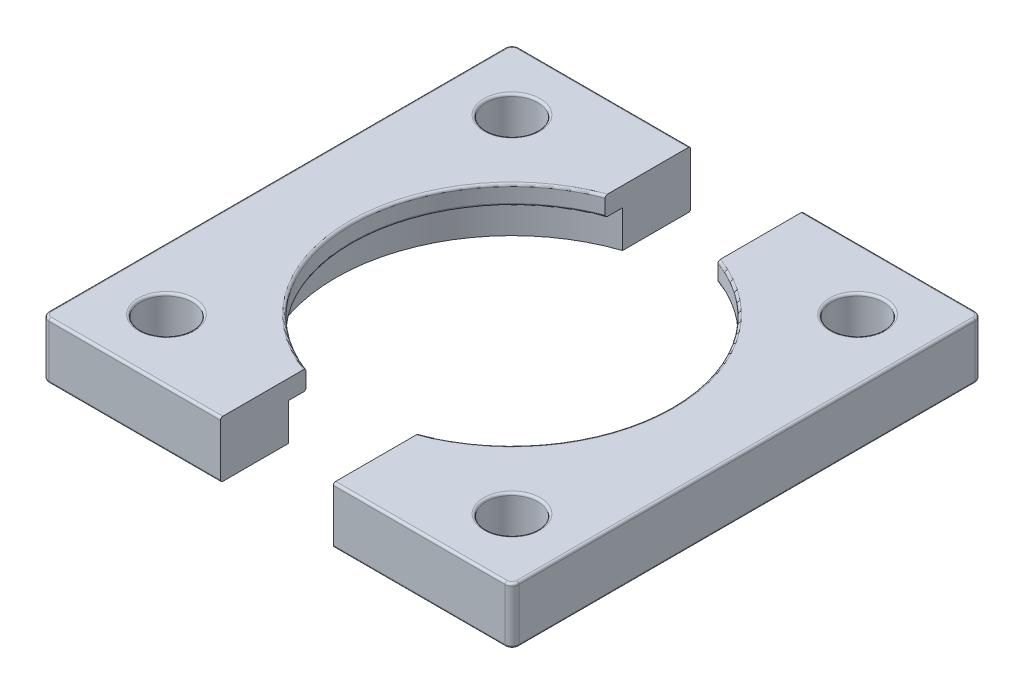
ISO-10303-21;
HEADER;
FILE_DESCRIPTION(('STEP AP214'),'2;1');
FILE_NAME('part.step','',(''),(''),'','','');
FILE_SCHEMA(('AUTOMOTIVE_DESIGN { 1 0 10303 214 1 1 1 1 }'));
ENDSEC;
DATA;
#1=APPLICATION_CONTEXT('core data for automotive mechanical design processes');
#2=APPLICATION_PROTOCOL_DEFINITION('international standard','automotive_design',2000,#1);
#3=PRODUCT_CONTEXT('',#1,'mechanical');
#4=PRODUCT('Part','Part','',(#3));
#5=PRODUCT_RELATED_PRODUCT_CATEGORY('part','',(#4));
#6=PRODUCT_DEFINITION_FORMATION('','',#4);
#7=PRODUCT_DEFINITION_CONTEXT('part definition',#1,'design');
#8=PRODUCT_DEFINITION('design','',#6,#7);
#9=PRODUCT_DEFINITION_SHAPE('','',#8);
#10=(LENGTH_UNIT() NAMED_UNIT(*) SI_UNIT(.MILLI.,.METRE.));
#11=(NAMED_UNIT(*) PLANE_ANGLE_UNIT() SI_UNIT($,.RADIAN.));
#12=(NAMED_UNIT(*) SI_UNIT($,.STERADIAN.) SOLID_ANGLE_UNIT());
#13=UNCERTAINTY_MEASURE_WITH_UNIT(LENGTH_MEASURE(1.E-05),#10,'distance_accuracy_value','');
#14=(GEOMETRIC_REPRESENTATION_CONTEXT(3) GLOBAL_UNCERTAINTY_ASSIGNED_CONTEXT((#13)) GLOBAL_UNIT_ASSIGNED_CONTEXT((#10,
#11,#12)) REPRESENTATION_CONTEXT('',''));
#15=CARTESIAN_POINT('',(0.,0.,0.));
#16=DIRECTION('',(0.,0.,1.));
#17=DIRECTION('',(1.,0.,0.));
#18=AXIS2_PLACEMENT_3D('',#15,#16,#17);
#19=CARTESIAN_POINT('',(0.,12.,0.));
#20=DIRECTION('',(0.,-1.,0.));
#21=DIRECTION('',(0.,0.,-1.));
#22=AXIS2_PLACEMENT_3D('',#19,#20,#21);
#23=CYLINDRICAL_SURFACE('',#22,34.);
#24=DIRECTION('',(0.,-1.,0.));
#25=VECTOR('',#24,1.);
#26=CARTESIAN_POINT('',(-12.,12.,-31.8119474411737));
#27=LINE('',#26,#25);
#28=CARTESIAN_POINT('',(-12.,11.5,-31.8119474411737));
#29=VERTEX_POINT('',#28);
#30=CARTESIAN_POINT('',(-12.,8.4,-31.8119474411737));
#31=VERTEX_POINT('',#30);
#32=EDGE_CURVE('E230',#29,#31,#27,.T.);
#33=ORIENTED_EDGE('',*,*,#32,.F.);
#34=CARTESIAN_POINT('',(0.,11.5,0.));
#35=DIRECTION('',(0.,1.,0.));
#36=DIRECTION('',(0.,0.,1.));
#37=AXIS2_PLACEMENT_3D('',#34,#35,#36);
#38=CIRCLE('',#37,34.);
#39=CARTESIAN_POINT('',(-12.,11.5,31.8119474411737));
#40=VERTEX_POINT('',#39);
#41=EDGE_CURVE('E411',#29,#40,#38,.T.);
#42=ORIENTED_EDGE('',*,*,#41,.T.);
#43=DIRECTION('',(0.,-1.,0.));
#44=VECTOR('',#43,1.);
#45=CARTESIAN_POINT('',(-12.,12.,31.8119474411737));
#46=LINE('',#45,#44);
#47=CARTESIAN_POINT('',(-12.,8.4,31.8119474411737));
#48=VERTEX_POINT('',#47);
#49=EDGE_CURVE('E233',#40,#48,#46,.T.);
#50=ORIENTED_EDGE('',*,*,#49,.T.);
#51=CARTESIAN_POINT('',(0.,8.4,0.));
#52=DIRECTION('',(0.,-1.,0.));
#53=DIRECTION('',(0.,0.,-1.));
#54=AXIS2_PLACEMENT_3D('',#51,#52,#53);
#55=CIRCLE('',#54,34.);
#56=EDGE_CURVE('E413',#48,#31,#55,.T.);
#57=ORIENTED_EDGE('',*,*,#56,.T.);
#58=EDGE_LOOP('',(#33,#42,#50,#57));
#59=FACE_BOUND('',#58,.T.);
#60=ADVANCED_FACE('F42',(#59),#23,.F.);
#61=CARTESIAN_POINT('',(-48.5,12.,48.5));
#62=DIRECTION('',(0.,1.,0.));
#63=DIRECTION('',(0.,0.,1.));
#64=AXIS2_PLACEMENT_3D('',#61,#62,#63);
#65=PLANE('',#64);
#66=DIRECTION('',(0.,0.,-1.));
#67=VECTOR('',#66,1.);
#68=CARTESIAN_POINT('',(-12.,12.,31.8119474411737));
#69=LINE('',#68,#67);
#70=CARTESIAN_POINT('',(-12.,12.,49.5));
#71=VERTEX_POINT('',#70);
#72=CARTESIAN_POINT('',(-12.,12.,32.3457879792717));
#73=VERTEX_POINT('',#72);
#74=EDGE_CURVE('E211',#71,#73,#69,.T.);
#75=ORIENTED_EDGE('',*,*,#74,.T.);
#76=CARTESIAN_POINT('',(0.,12.,0.));
#77=DIRECTION('',(0.,1.,0.));
#78=DIRECTION('',(0.,0.,1.));
#79=AXIS2_PLACEMENT_3D('',#76,#77,#78);
#80=CIRCLE('',#79,34.5);
#81=CARTESIAN_POINT('',(-12.,12.,-32.3457879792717));
#82=VERTEX_POINT('',#81);
#83=EDGE_CURVE('E415',#73,#82,#80,.F.);
#84=ORIENTED_EDGE('',*,*,#83,.T.);
#85=DIRECTION('',(0.,0.,-1.));
#86=VECTOR('',#85,1.);
#87=CARTESIAN_POINT('',(-12.,12.,-50.));
#88=LINE('',#87,#86);
#89=CARTESIAN_POINT('',(-12.,12.,-49.5));
#90=VERTEX_POINT('',#89);
#91=EDGE_CURVE('E214',#82,#90,#88,.T.);
#92=ORIENTED_EDGE('',*,*,#91,.T.);
#93=DIRECTION('',(-1.,0.,0.));
#94=VECTOR('',#93,1.);
#95=CARTESIAN_POINT('',(-48.5,12.,-49.5));
#96=LINE('',#95,#94);
#97=CARTESIAN_POINT('',(-48.5,12.,-49.5));
#98=VERTEX_POINT('',#97);
#99=EDGE_CURVE('E418',#90,#98,#96,.T.);
#100=ORIENTED_EDGE('',*,*,#99,.T.);
#101=CARTESIAN_POINT('',(-48.5,12.,-48.5));
#102=DIRECTION('',(0.,1.,0.));
#103=DIRECTION('',(0.,0.,1.));
#104=AXIS2_PLACEMENT_3D('',#101,#102,#103);
#105=CIRCLE('',#104,1.);
#106=CARTESIAN_POINT('',(-49.5,12.,-48.5));
#107=VERTEX_POINT('',#106);
#108=EDGE_CURVE('E421',#98,#107,#105,.T.);
#109=ORIENTED_EDGE('',*,*,#108,.T.);
#110=DIRECTION('',(0.,0.,1.));
#111=VECTOR('',#110,1.);
#112=CARTESIAN_POINT('',(-49.5,12.,48.5));
#113=LINE('',#112,#111);
#114=CARTESIAN_POINT('',(-49.5,12.,48.5));
#115=VERTEX_POINT('',#114);
#116=EDGE_CURVE('E426',#107,#115,#113,.T.);
#117=ORIENTED_EDGE('',*,*,#116,.T.);
#118=CARTESIAN_POINT('',(-48.5,12.,48.5));
#119=DIRECTION('',(0.,1.,0.));
#120=DIRECTION('',(0.,0.,1.));
#121=AXIS2_PLACEMENT_3D('',#118,#119,#120);
#122=CIRCLE('',#121,1.);
#123=CARTESIAN_POINT('',(-48.5,12.,49.5));
#124=VERTEX_POINT('',#123);
#125=EDGE_CURVE('E67',#115,#124,#122,.T.);
#126=ORIENTED_EDGE('',*,*,#125,.T.);
#127=DIRECTION('',(1.,0.,0.));
#128=VECTOR('',#127,1.);
#129=CARTESIAN_POINT('',(-12.,12.,49.5));
#130=LINE('',#129,#128);
#131=EDGE_CURVE('E423',#124,#71,#130,.T.);
#132=ORIENTED_EDGE('',*,*,#131,.T.);
#133=EDGE_LOOP('',(#75,#84,#92,#100,#109,#117,#126,#132));
#134=FACE_BOUND('',#133,.T.);
#135=CARTESIAN_POINT('',(-36.75,12.,-36.75));
#136=DIRECTION('',(0.,1.,0.));
#137=DIRECTION('',(0.,0.,1.));
#138=AXIS2_PLACEMENT_3D('',#135,#136,#137);
#139=CIRCLE('',#138,5.99999999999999);
#140=CARTESIAN_POINT('',(-36.75,12.,-30.75));
#141=VERTEX_POINT('',#140);
#142=EDGE_CURVE('E428',#141,#141,#139,.F.);
#143=ORIENTED_EDGE('',*,*,#142,.T.);
#144=EDGE_LOOP('',(#143));
#145=FACE_BOUND('',#144,.T.);
#146=CARTESIAN_POINT('',(-36.75,12.,36.75));
#147=DIRECTION('',(0.,1.,0.));
#148=DIRECTION('',(0.,0.,1.));
#149=AXIS2_PLACEMENT_3D('',#146,#147,#148);
#150=CIRCLE('',#149,5.99999999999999);
#151=CARTESIAN_POINT('',(-36.75,12.,42.75));
#152=VERTEX_POINT('',#151);
#153=EDGE_CURVE('E377',#152,#152,#150,.F.);
#154=ORIENTED_EDGE('',*,*,#153,.T.);
#155=EDGE_LOOP('',(#154));
#156=FACE_BOUND('',#155,.T.);
#157=ADVANCED_FACE('F287',(#134,#145,#156),#65,.T.);
#158=CARTESIAN_POINT('',(-48.5,0.,48.5));
#159=DIRECTION('',(0.,1.,0.));
#160=DIRECTION('',(0.,0.,1.));
#161=AXIS2_PLACEMENT_3D('',#158,#159,#160);
#162=PLANE('',#161);
#163=CARTESIAN_POINT('',(-36.75,0.,-36.75));
#164=DIRECTION('',(0.,1.,0.));
#165=DIRECTION('',(0.,0.,1.));
#166=AXIS2_PLACEMENT_3D('',#163,#164,#165);
#167=CIRCLE('',#166,5.5);
#168=CARTESIAN_POINT('',(-36.75,0.,-31.25));
#169=VERTEX_POINT('',#168);
#170=EDGE_CURVE('E183',#169,#169,#167,.T.);
#171=ORIENTED_EDGE('',*,*,#170,.T.);
#172=EDGE_LOOP('',(#171));
#173=FACE_BOUND('',#172,.T.);
#174=CARTESIAN_POINT('',(-48.5,0.,-48.5));
#175=DIRECTION('',(0.,1.,0.));
#176=DIRECTION('',(0.,0.,1.));
#177=AXIS2_PLACEMENT_3D('',#174,#175,#176);
#178=CIRCLE('',#177,1.);
#179=CARTESIAN_POINT('',(-49.5,0.,-48.5));
#180=VERTEX_POINT('',#179);
#181=CARTESIAN_POINT('',(-48.5,0.,-49.5));
#182=VERTEX_POINT('',#181);
#183=EDGE_CURVE('E257',#180,#182,#178,.F.);
#184=ORIENTED_EDGE('',*,*,#183,.T.);
#185=DIRECTION('',(-1.,0.,0.));
#186=VECTOR('',#185,1.);
#187=CARTESIAN_POINT('',(-48.5,0.,-49.5));
#188=LINE('',#187,#186);
#189=CARTESIAN_POINT('',(-12.,0.,-49.5));
#190=VERTEX_POINT('',#189);
#191=EDGE_CURVE('E259',#182,#190,#188,.F.);
#192=ORIENTED_EDGE('',*,*,#191,.T.);
#193=DIRECTION('',(0.,0.,-1.));
#194=VECTOR('',#193,1.);
#195=CARTESIAN_POINT('',(-12.,0.,-50.));
#196=LINE('',#195,#194);
#197=CARTESIAN_POINT('',(-12.,0.,-35.528157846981));
#198=VERTEX_POINT('',#197);
#199=EDGE_CURVE('E182',#198,#190,#196,.T.);
#200=ORIENTED_EDGE('',*,*,#199,.F.);
#201=CARTESIAN_POINT('',(0.,0.,0.));
#202=DIRECTION('',(0.,-1.,0.));
#203=DIRECTION('',(0.,0.,-1.));
#204=AXIS2_PLACEMENT_3D('',#201,#202,#203);
#205=CIRCLE('',#204,37.5);
#206=CARTESIAN_POINT('',(-12.,0.,35.528157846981));
#207=VERTEX_POINT('',#206);
#208=EDGE_CURVE('E189',#207,#198,#205,.T.);
#209=ORIENTED_EDGE('',*,*,#208,.F.);
#210=DIRECTION('',(0.,0.,-1.));
#211=VECTOR('',#210,1.);
#212=CARTESIAN_POINT('',(-12.,0.,31.8119474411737));
#213=LINE('',#212,#211);
#214=CARTESIAN_POINT('',(-12.,0.,49.5));
#215=VERTEX_POINT('',#214);
#216=EDGE_CURVE('E171',#215,#207,#213,.T.);
#217=ORIENTED_EDGE('',*,*,#216,.F.);
#218=DIRECTION('',(1.,0.,0.));
#219=VECTOR('',#218,1.);
#220=CARTESIAN_POINT('',(-48.5,0.,49.5));
#221=LINE('',#220,#219);
#222=CARTESIAN_POINT('',(-48.5,0.,49.5));
#223=VERTEX_POINT('',#222);
#224=EDGE_CURVE('E255',#215,#223,#221,.F.);
#225=ORIENTED_EDGE('',*,*,#224,.T.);
#226=CARTESIAN_POINT('',(-48.5,0.,48.5));
#227=DIRECTION('',(0.,1.,0.));
#228=DIRECTION('',(0.,0.,1.));
#229=AXIS2_PLACEMENT_3D('',#226,#227,#228);
#230=CIRCLE('',#229,1.);
#231=CARTESIAN_POINT('',(-49.5,0.,48.5));
#232=VERTEX_POINT('',#231);
#233=EDGE_CURVE('E253',#223,#232,#230,.F.);
#234=ORIENTED_EDGE('',*,*,#233,.T.);
#235=DIRECTION('',(0.,0.,1.));
#236=VECTOR('',#235,1.);
#237=CARTESIAN_POINT('',(-49.5,0.,48.5));
#238=LINE('',#237,#236);
#239=EDGE_CURVE('E251',#232,#180,#238,.F.);
#240=ORIENTED_EDGE('',*,*,#239,.T.);
#241=EDGE_LOOP('',(#184,#192,#200,#209,#217,#225,#234,#240));
#242=FACE_BOUND('',#241,.T.);
#243=CARTESIAN_POINT('',(-36.75,0.,36.75));
#244=DIRECTION('',(0.,1.,0.));
#245=DIRECTION('',(0.,0.,-1.));
#246=AXIS2_PLACEMENT_3D('',#243,#244,#245);
#247=CIRCLE('',#246,5.5);
#248=CARTESIAN_POINT('',(-36.75,0.,31.25));
#249=VERTEX_POINT('',#248);
#250=EDGE_CURVE('E192',#249,#249,#247,.T.);
#251=ORIENTED_EDGE('',*,*,#250,.T.);
#252=EDGE_LOOP('',(#251));
#253=FACE_BOUND('',#252,.T.);
#254=ADVANCED_FACE('F196',(#173,#242,#253),#162,.F.);
#255=CARTESIAN_POINT('',(-48.5,12.,48.5));
#256=DIRECTION('',(0.,-1.,0.));
#257=DIRECTION('',(0.,0.,-1.));
#258=AXIS2_PLACEMENT_3D('',#255,#256,#257);
#259=CYLINDRICAL_SURFACE('',#258,1.5);
#260=DIRECTION('',(0.,-1.,0.));
#261=VECTOR('',#260,1.);
#262=CARTESIAN_POINT('',(-50.,12.,48.5));
#263=LINE('',#262,#261);
#264=CARTESIAN_POINT('',(-50.,11.5,48.5));
#265=VERTEX_POINT('',#264);
#266=CARTESIAN_POINT('',(-50.,0.5,48.5));
#267=VERTEX_POINT('',#266);
#268=EDGE_CURVE('E216',#265,#267,#263,.T.);
#269=ORIENTED_EDGE('',*,*,#268,.T.);
#270=CARTESIAN_POINT('',(-48.5,0.5,48.5));
#271=DIRECTION('',(0.,1.,0.));
#272=DIRECTION('',(0.,0.,1.));
#273=AXIS2_PLACEMENT_3D('',#270,#271,#272);
#274=CIRCLE('',#273,1.5);
#275=CARTESIAN_POINT('',(-48.5,0.5,50.));
#276=VERTEX_POINT('',#275);
#277=EDGE_CURVE('E367',#267,#276,#274,.T.);
#278=ORIENTED_EDGE('',*,*,#277,.T.);
#279=DIRECTION('',(0.,-1.,0.));
#280=VECTOR('',#279,1.);
#281=CARTESIAN_POINT('',(-48.5,12.,50.));
#282=LINE('',#281,#280);
#283=CARTESIAN_POINT('',(-48.5,11.5,50.));
#284=VERTEX_POINT('',#283);
#285=EDGE_CURVE('E238',#284,#276,#282,.T.);
#286=ORIENTED_EDGE('',*,*,#285,.F.);
#287=CARTESIAN_POINT('',(-48.5,11.5,48.5));
#288=DIRECTION('',(0.,1.,0.));
#289=DIRECTION('',(0.,0.,1.));
#290=AXIS2_PLACEMENT_3D('',#287,#288,#289);
#291=CIRCLE('',#290,1.5);
#292=EDGE_CURVE('E369',#284,#265,#291,.F.);
#293=ORIENTED_EDGE('',*,*,#292,.T.);
#294=EDGE_LOOP('',(#269,#278,#286,#293));
#295=FACE_BOUND('',#294,.T.);
#296=ADVANCED_FACE('F354',(#295),#259,.T.);
#297=CARTESIAN_POINT('',(-48.5,12.,50.));
#298=DIRECTION('',(0.,0.,-1.));
#299=DIRECTION('',(-1.,0.,0.));
#300=AXIS2_PLACEMENT_3D('',#297,#298,#299);
#301=PLANE('',#300);
#302=ORIENTED_EDGE('',*,*,#285,.T.);
#303=DIRECTION('',(1.,0.,0.));
#304=VECTOR('',#303,1.);
#305=CARTESIAN_POINT('',(-48.5,0.5,50.));
#306=LINE('',#305,#304);
#307=CARTESIAN_POINT('',(-12.,0.5,50.));
#308=VERTEX_POINT('',#307);
#309=EDGE_CURVE('E439',#276,#308,#306,.T.);
#310=ORIENTED_EDGE('',*,*,#309,.T.);
#311=DIRECTION('',(0.,-1.,0.));
#312=VECTOR('',#311,1.);
#313=CARTESIAN_POINT('',(-12.,12.,50.));
#314=LINE('',#313,#312);
#315=CARTESIAN_POINT('',(-12.,11.5,50.));
#316=VERTEX_POINT('',#315);
#317=EDGE_CURVE('E236',#316,#308,#314,.T.);
#318=ORIENTED_EDGE('',*,*,#317,.F.);
#319=DIRECTION('',(1.,0.,0.));
#320=VECTOR('',#319,1.);
#321=CARTESIAN_POINT('',(-48.5,11.5,50.));
#322=LINE('',#321,#320);
#323=EDGE_CURVE('E437',#316,#284,#322,.F.);
#324=ORIENTED_EDGE('',*,*,#323,.T.);
#325=EDGE_LOOP('',(#302,#310,#318,#324));
#326=FACE_BOUND('',#325,.T.);
#327=ADVANCED_FACE('F292',(#326),#301,.F.);
#328=CARTESIAN_POINT('',(-12.,12.,31.8119474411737));
#329=DIRECTION('',(-1.,0.,0.));
#330=DIRECTION('',(0.,0.,1.));
#331=AXIS2_PLACEMENT_3D('',#328,#329,#330);
#332=PLANE('',#331);
#333=ORIENTED_EDGE('',*,*,#317,.T.);
#334=CARTESIAN_POINT('',(-12.,0.5,49.5));
#335=DIRECTION('',(-1.,0.,0.));
#336=DIRECTION('',(0.,0.,1.));
#337=AXIS2_PLACEMENT_3D('',#334,#335,#336);
#338=CIRCLE('',#337,0.5);
#339=EDGE_CURVE('E178',#308,#215,#338,.F.);
#340=ORIENTED_EDGE('',*,*,#339,.T.);
#341=ORIENTED_EDGE('',*,*,#216,.T.);
#342=DIRECTION('',(0.,-1.,0.));
#343=VECTOR('',#342,1.);
#344=CARTESIAN_POINT('',(-12.,7.9,35.528157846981));
#345=LINE('',#344,#343);
#346=CARTESIAN_POINT('',(-12.,7.9,35.528157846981));
#347=VERTEX_POINT('',#346);
#348=EDGE_CURVE('E176',#207,#347,#345,.F.);
#349=ORIENTED_EDGE('',*,*,#348,.T.);
#350=DIRECTION('',(0.,0.,1.));
#351=VECTOR('',#350,1.);
#352=CARTESIAN_POINT('',(-12.,7.9,31.8119474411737));
#353=LINE('',#352,#351);
#354=CARTESIAN_POINT('',(-12.,7.9,32.3457879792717));
#355=VERTEX_POINT('',#354);
#356=EDGE_CURVE('E193',#355,#347,#353,.T.);
#357=ORIENTED_EDGE('',*,*,#356,.F.);
#358=CARTESIAN_POINT('',(-12.,7.9,32.3457879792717));
#359=CARTESIAN_POINT('',(-12.,7.89998354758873,32.3142261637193));
#360=CARTESIAN_POINT('',(-12.,7.90262632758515,32.2826604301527));
#361=CARTESIAN_POINT('',(-12.,7.91311692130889,32.2203665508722));
#362=CARTESIAN_POINT('',(-12.,7.92097118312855,32.1896394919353));
#363=CARTESIAN_POINT('',(-12.,7.94178225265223,32.1299180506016));
#364=CARTESIAN_POINT('',(-12.,7.95474468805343,32.1009256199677));
#365=CARTESIAN_POINT('',(-12.,7.98550375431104,32.0456448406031));
#366=CARTESIAN_POINT('',(-12.,8.00329686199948,32.0193545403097));
#367=CARTESIAN_POINT('',(-12.,8.04266112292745,31.9711862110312));
#368=CARTESIAN_POINT('',(-12.,8.06409000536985,31.9491921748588));
#369=CARTESIAN_POINT('',(-12.,8.11056660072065,31.9094069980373));
#370=CARTESIAN_POINT('',(-12.,8.13561420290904,31.8916157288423));
#371=CARTESIAN_POINT('',(-12.,8.18689206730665,31.8619729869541));
#372=CARTESIAN_POINT('',(-12.,8.21294593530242,31.8498158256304));
#373=CARTESIAN_POINT('',(-12.,8.2667922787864,31.8303696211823));
#374=CARTESIAN_POINT('',(-12.,8.29458189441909,31.8230727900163));
#375=CARTESIAN_POINT('',(-12.,8.33553685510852,31.8162263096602));
#376=CARTESIAN_POINT('',(-12.,8.34838661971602,31.8146222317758));
#377=CARTESIAN_POINT('',(-12.,8.37415528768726,31.8124836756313));
#378=CARTESIAN_POINT('',(-12.,8.38707405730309,31.8119475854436));
#379=CARTESIAN_POINT('',(-12.,8.4,31.8119474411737));
#380=B_SPLINE_CURVE_WITH_KNOTS('',3,(#358,#359,#360,#361,#362,#363,#364,#365,#366,#367,#368,
#369,#370,#371,#372,#373,#374,#375,#376,#377,#378,#379),.UNSPECIFIED.,.F.,.F.,(4,2,2,2,2,2,2,2,
2,2,4),(0.,0.0945830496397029,0.189283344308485,0.284088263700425,0.378824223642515,
0.470468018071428,0.562109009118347,0.647924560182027,0.733602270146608,0.772413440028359,
0.811165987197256),.UNSPECIFIED.);
#381=EDGE_CURVE('E296',#355,#48,#380,.T.);
#382=ORIENTED_EDGE('',*,*,#381,.T.);
#383=ORIENTED_EDGE('',*,*,#49,.F.);
#384=CARTESIAN_POINT('',(-12.,11.5,31.8119474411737));
#385=CARTESIAN_POINT('',(-12.,11.5268333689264,31.8119162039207));
#386=CARTESIAN_POINT('',(-12.,11.5536488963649,31.814253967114));
#387=CARTESIAN_POINT('',(-12.,11.606432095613,31.8234238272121));
#388=CARTESIAN_POINT('',(-12.,11.6324017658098,31.8302443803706));
#389=CARTESIAN_POINT('',(-12.,11.6828223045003,31.8481369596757));
#390=CARTESIAN_POINT('',(-12.,11.7072734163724,31.8592083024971));
#391=CARTESIAN_POINT('',(-12.,11.7540427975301,31.8851926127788));
#392=CARTESIAN_POINT('',(-12.,11.7763603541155,31.9001068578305));
#393=CARTESIAN_POINT('',(-12.,11.818910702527,31.9337334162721));
#394=CARTESIAN_POINT('',(-12.,11.8390708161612,31.9525375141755));
#395=CARTESIAN_POINT('',(-12.,11.8761698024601,31.993089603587));
#396=CARTESIAN_POINT('',(-12.,11.8931078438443,32.0148383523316));
#397=CARTESIAN_POINT('',(-12.,11.9243756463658,32.0620688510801));
#398=CARTESIAN_POINT('',(-12.,11.938483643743,32.0876973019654));
#399=CARTESIAN_POINT('',(-12.,11.9624712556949,32.1408658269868));
#400=CARTESIAN_POINT('',(-12.,11.9723497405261,32.1684064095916));
#401=CARTESIAN_POINT('',(-12.,11.9866681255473,32.2208411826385));
#402=CARTESIAN_POINT('',(-12.,11.9916652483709,32.2455853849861));
#403=CARTESIAN_POINT('',(-12.,11.9983313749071,32.2954817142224));
#404=CARTESIAN_POINT('',(-12.,12.0000052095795,32.3206331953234));
#405=CARTESIAN_POINT('',(-12.,12.,32.3457879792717));
#406=B_SPLINE_CURVE_WITH_KNOTS('',3,(#384,#385,#386,#387,#388,#389,#390,#391,#392,#393,#394,
#395,#396,#397,#398,#399,#400,#401,#402,#403,#404,#405),.UNSPECIFIED.,.F.,.F.,(4,2,2,2,2,2,2,2,
2,2,4),(0.,0.0803708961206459,0.16053563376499,0.240687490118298,0.320866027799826,
0.403212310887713,0.485579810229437,0.572965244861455,0.660374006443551,0.735886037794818,
0.811288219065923),.UNSPECIFIED.);
#407=EDGE_CURVE('E302',#40,#73,#406,.T.);
#408=ORIENTED_EDGE('',*,*,#407,.T.);
#409=ORIENTED_EDGE('',*,*,#74,.F.);
#410=CARTESIAN_POINT('',(-12.,11.5,49.5));
#411=DIRECTION('',(-1.,0.,0.));
#412=DIRECTION('',(0.,0.,1.));
#413=AXIS2_PLACEMENT_3D('',#410,#411,#412);
#414=CIRCLE('',#413,0.5);
#415=EDGE_CURVE('E307',#71,#316,#414,.F.);
#416=ORIENTED_EDGE('',*,*,#415,.T.);
#417=EDGE_LOOP('',(#333,#340,#341,#349,#357,#382,#383,#408,#409,#416));
#418=FACE_BOUND('',#417,.T.);
#419=ADVANCED_FACE('F174',(#418),#332,.F.);
#420=CARTESIAN_POINT('',(-12.,12.,-50.));
#421=DIRECTION('',(-1.,0.,0.));
#422=DIRECTION('',(0.,0.,1.));
#423=AXIS2_PLACEMENT_3D('',#420,#421,#422);
#424=PLANE('',#423);
#425=ORIENTED_EDGE('',*,*,#199,.T.);
#426=CARTESIAN_POINT('',(-12.,0.5,-49.5));
#427=DIRECTION('',(-1.,0.,0.));
#428=DIRECTION('',(0.,0.,1.));
#429=AXIS2_PLACEMENT_3D('',#426,#427,#428);
#430=CIRCLE('',#429,0.5);
#431=CARTESIAN_POINT('',(-12.,0.5,-50.));
#432=VERTEX_POINT('',#431);
#433=EDGE_CURVE('E446',#190,#432,#430,.F.);
#434=ORIENTED_EDGE('',*,*,#433,.T.);
#435=DIRECTION('',(0.,-1.,0.));
#436=VECTOR('',#435,1.);
#437=CARTESIAN_POINT('',(-12.,12.,-50.));
#438=LINE('',#437,#436);
#439=CARTESIAN_POINT('',(-12.,11.5,-50.));
#440=VERTEX_POINT('',#439);
#441=EDGE_CURVE('E227',#440,#432,#438,.T.);
#442=ORIENTED_EDGE('',*,*,#441,.F.);
#443=CARTESIAN_POINT('',(-12.,11.5,-49.5));
#444=DIRECTION('',(-1.,0.,0.));
#445=DIRECTION('',(0.,0.,1.));
#446=AXIS2_PLACEMENT_3D('',#443,#444,#445);
#447=CIRCLE('',#446,0.5);
#448=EDGE_CURVE('E447',#440,#90,#447,.F.);
#449=ORIENTED_EDGE('',*,*,#448,.T.);
#450=ORIENTED_EDGE('',*,*,#91,.F.);
#451=CARTESIAN_POINT('',(-12.,12.,-32.3457879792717));
#452=CARTESIAN_POINT('',(-12.,12.0000164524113,-32.3142261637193));
#453=CARTESIAN_POINT('',(-12.,11.9973736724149,-32.2826604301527));
#454=CARTESIAN_POINT('',(-12.,11.9868830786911,-32.2203665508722));
#455=CARTESIAN_POINT('',(-12.,11.9790288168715,-32.1896394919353));
#456=CARTESIAN_POINT('',(-12.,11.9582177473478,-32.1299180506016));
#457=CARTESIAN_POINT('',(-12.,11.9452553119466,-32.1009256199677));
#458=CARTESIAN_POINT('',(-12.,11.914496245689,-32.0456448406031));
#459=CARTESIAN_POINT('',(-12.,11.8967031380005,-32.0193545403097));
#460=CARTESIAN_POINT('',(-12.,11.8573388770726,-31.9711862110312));
#461=CARTESIAN_POINT('',(-12.,11.8359099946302,-31.9491921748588));
#462=CARTESIAN_POINT('',(-12.,11.7894333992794,-31.9094069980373));
#463=CARTESIAN_POINT('',(-12.,11.764385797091,-31.8916157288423));
#464=CARTESIAN_POINT('',(-12.,11.7131079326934,-31.8619729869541));
#465=CARTESIAN_POINT('',(-12.,11.6870540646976,-31.8498158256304));
#466=CARTESIAN_POINT('',(-12.,11.6332077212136,-31.8303696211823));
#467=CARTESIAN_POINT('',(-12.,11.6054181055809,-31.8230727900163));
#468=CARTESIAN_POINT('',(-12.,11.5644631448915,-31.8162263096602));
#469=CARTESIAN_POINT('',(-12.,11.551613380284,-31.8146222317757));
#470=CARTESIAN_POINT('',(-12.,11.5258447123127,-31.8124836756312));
#471=CARTESIAN_POINT('',(-12.,11.5129259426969,-31.8119475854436));
#472=CARTESIAN_POINT('',(-12.,11.5,-31.8119474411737));
#473=B_SPLINE_CURVE_WITH_KNOTS('',3,(#451,#452,#453,#454,#455,#456,#457,#458,#459,#460,#461,
#462,#463,#464,#465,#466,#467,#468,#469,#470,#471,#472),.UNSPECIFIED.,.F.,.F.,(4,2,2,2,2,2,2,2,
2,2,4),(0.,0.094583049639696,0.189283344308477,0.284088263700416,0.378824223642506,
0.470468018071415,0.562109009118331,0.647924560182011,0.733602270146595,0.772413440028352,
0.811165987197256),.UNSPECIFIED.);
#474=EDGE_CURVE('E268',#82,#29,#473,.T.);
#475=ORIENTED_EDGE('',*,*,#474,.T.);
#476=ORIENTED_EDGE('',*,*,#32,.T.);
#477=CARTESIAN_POINT('',(-12.,8.4,-31.8119474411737));
#478=CARTESIAN_POINT('',(-12.,8.37316663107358,-31.8119162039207));
#479=CARTESIAN_POINT('',(-12.,8.34635110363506,-31.814253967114));
#480=CARTESIAN_POINT('',(-12.,8.29356790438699,-31.8234238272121));
#481=CARTESIAN_POINT('',(-12.,8.26759823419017,-31.8302443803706));
#482=CARTESIAN_POINT('',(-12.,8.21717769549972,-31.8481369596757));
#483=CARTESIAN_POINT('',(-12.,8.19272658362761,-31.8592083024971));
#484=CARTESIAN_POINT('',(-12.,8.14595720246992,-31.8851926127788));
#485=CARTESIAN_POINT('',(-12.,8.12363964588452,-31.9001068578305));
#486=CARTESIAN_POINT('',(-12.,8.08108929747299,-31.9337334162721));
#487=CARTESIAN_POINT('',(-12.,8.06092918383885,-31.9525375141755));
#488=CARTESIAN_POINT('',(-12.,8.02383019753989,-31.993089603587));
#489=CARTESIAN_POINT('',(-12.,8.00689215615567,-32.0148383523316));
#490=CARTESIAN_POINT('',(-12.,7.97562435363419,-32.0620688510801));
#491=CARTESIAN_POINT('',(-12.,7.96151635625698,-32.0876973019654));
#492=CARTESIAN_POINT('',(-12.,7.93752874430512,-32.1408658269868));
#493=CARTESIAN_POINT('',(-12.,7.92765025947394,-32.1684064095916));
#494=CARTESIAN_POINT('',(-12.,7.91333187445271,-32.2208411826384));
#495=CARTESIAN_POINT('',(-12.,7.90833475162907,-32.2455853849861));
#496=CARTESIAN_POINT('',(-12.,7.90166862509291,-32.2954817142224));
#497=CARTESIAN_POINT('',(-12.,7.89999479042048,-32.3206331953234));
#498=CARTESIAN_POINT('',(-12.,7.9,-32.3457879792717));
#499=B_SPLINE_CURVE_WITH_KNOTS('',3,(#477,#478,#479,#480,#481,#482,#483,#484,#485,#486,#487,
#488,#489,#490,#491,#492,#493,#494,#495,#496,#497,#498),.UNSPECIFIED.,.F.,.F.,(4,2,2,2,2,2,2,2,
2,2,4),(0.,0.080370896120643,0.160535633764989,0.240687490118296,0.320866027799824,
0.403212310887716,0.485579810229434,0.572965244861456,0.660374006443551,0.735886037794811,
0.811288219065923),.UNSPECIFIED.);
#500=CARTESIAN_POINT('',(-12.,7.9,-32.3457879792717));
#501=VERTEX_POINT('',#500);
#502=EDGE_CURVE('E261',#31,#501,#499,.T.);
#503=ORIENTED_EDGE('',*,*,#502,.T.);
#504=DIRECTION('',(0.,0.,1.));
#505=VECTOR('',#504,1.);
#506=CARTESIAN_POINT('',(-12.,7.9,-50.));
#507=LINE('',#506,#505);
#508=CARTESIAN_POINT('',(-12.,7.9,-35.528157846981));
#509=VERTEX_POINT('',#508);
#510=EDGE_CURVE('E241',#509,#501,#507,.T.);
#511=ORIENTED_EDGE('',*,*,#510,.F.);
#512=DIRECTION('',(0.,-1.,0.));
#513=VECTOR('',#512,1.);
#514=CARTESIAN_POINT('',(-12.,7.9,-35.528157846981));
#515=LINE('',#514,#513);
#516=EDGE_CURVE('E244',#509,#198,#515,.T.);
#517=ORIENTED_EDGE('',*,*,#516,.T.);
#518=EDGE_LOOP('',(#425,#434,#442,#449,#450,#475,#476,#503,#511,#517));
#519=FACE_BOUND('',#518,.T.);
#520=ADVANCED_FACE('F276',(#519),#424,.F.);
#521=CARTESIAN_POINT('',(-48.5,12.,-50.));
#522=DIRECTION('',(0.,0.,1.));
#523=DIRECTION('',(1.,0.,0.));
#524=AXIS2_PLACEMENT_3D('',#521,#522,#523);
#525=PLANE('',#524);
#526=ORIENTED_EDGE('',*,*,#441,.T.);
#527=DIRECTION('',(-1.,0.,0.));
#528=VECTOR('',#527,1.);
#529=CARTESIAN_POINT('',(-48.5,0.5,-50.));
#530=LINE('',#529,#528);
#531=CARTESIAN_POINT('',(-48.5,0.5,-50.));
#532=VERTEX_POINT('',#531);
#533=EDGE_CURVE('E248',#432,#532,#530,.T.);
#534=ORIENTED_EDGE('',*,*,#533,.T.);
#535=DIRECTION('',(0.,-1.,0.));
#536=VECTOR('',#535,1.);
#537=CARTESIAN_POINT('',(-48.5,12.,-50.));
#538=LINE('',#537,#536);
#539=CARTESIAN_POINT('',(-48.5,11.5,-50.));
#540=VERTEX_POINT('',#539);
#541=EDGE_CURVE('E224',#540,#532,#538,.T.);
#542=ORIENTED_EDGE('',*,*,#541,.F.);
#543=DIRECTION('',(-1.,0.,0.));
#544=VECTOR('',#543,1.);
#545=CARTESIAN_POINT('',(-12.,11.5,-50.));
#546=LINE('',#545,#544);
#547=EDGE_CURVE('E246',#540,#440,#546,.F.);
#548=ORIENTED_EDGE('',*,*,#547,.T.);
#549=EDGE_LOOP('',(#526,#534,#542,#548));
#550=FACE_BOUND('',#549,.T.);
#551=ADVANCED_FACE('F281',(#550),#525,.F.);
#552=CARTESIAN_POINT('',(-48.5,12.,-48.5));
#553=DIRECTION('',(0.,-1.,0.));
#554=DIRECTION('',(0.,0.,-1.));
#555=AXIS2_PLACEMENT_3D('',#552,#553,#554);
#556=CYLINDRICAL_SURFACE('',#555,1.5);
#557=ORIENTED_EDGE('',*,*,#541,.T.);
#558=CARTESIAN_POINT('',(-48.5,0.5,-48.5));
#559=DIRECTION('',(0.,1.,0.));
#560=DIRECTION('',(0.,0.,1.));
#561=AXIS2_PLACEMENT_3D('',#558,#559,#560);
#562=CIRCLE('',#561,1.5);
#563=CARTESIAN_POINT('',(-50.,0.5,-48.5));
#564=VERTEX_POINT('',#563);
#565=EDGE_CURVE('E440',#532,#564,#562,.T.);
#566=ORIENTED_EDGE('',*,*,#565,.T.);
#567=DIRECTION('',(0.,-1.,0.));
#568=VECTOR('',#567,1.);
#569=CARTESIAN_POINT('',(-50.,12.,-48.5));
#570=LINE('',#569,#568);
#571=CARTESIAN_POINT('',(-50.,11.5,-48.5));
#572=VERTEX_POINT('',#571);
#573=EDGE_CURVE('E221',#572,#564,#570,.T.);
#574=ORIENTED_EDGE('',*,*,#573,.F.);
#575=CARTESIAN_POINT('',(-48.5,11.5,-48.5));
#576=DIRECTION('',(0.,1.,0.));
#577=DIRECTION('',(0.,0.,1.));
#578=AXIS2_PLACEMENT_3D('',#575,#576,#577);
#579=CIRCLE('',#578,1.5);
#580=EDGE_CURVE('E442',#572,#540,#579,.F.);
#581=ORIENTED_EDGE('',*,*,#580,.T.);
#582=EDGE_LOOP('',(#557,#566,#574,#581));
#583=FACE_BOUND('',#582,.T.);
#584=ADVANCED_FACE('F466',(#583),#556,.T.);
#585=CARTESIAN_POINT('',(-50.,12.,-48.5));
#586=DIRECTION('',(1.,0.,0.));
#587=DIRECTION('',(0.,0.,-1.));
#588=AXIS2_PLACEMENT_3D('',#585,#586,#587);
#589=PLANE('',#588);
#590=ORIENTED_EDGE('',*,*,#573,.T.);
#591=DIRECTION('',(0.,0.,1.));
#592=VECTOR('',#591,1.);
#593=CARTESIAN_POINT('',(-50.,0.5,-48.5));
#594=LINE('',#593,#592);
#595=EDGE_CURVE('E381',#564,#267,#594,.T.);
#596=ORIENTED_EDGE('',*,*,#595,.T.);
#597=ORIENTED_EDGE('',*,*,#268,.F.);
#598=DIRECTION('',(0.,0.,1.));
#599=VECTOR('',#598,1.);
#600=CARTESIAN_POINT('',(-50.,11.5,-48.5));
#601=LINE('',#600,#599);
#602=EDGE_CURVE('E406',#265,#572,#601,.F.);
#603=ORIENTED_EDGE('',*,*,#602,.T.);
#604=EDGE_LOOP('',(#590,#596,#597,#603));
#605=FACE_BOUND('',#604,.T.);
#606=ADVANCED_FACE('F464',(#605),#589,.F.);
#607=CARTESIAN_POINT('',(-36.75,12.,-36.75));
#608=DIRECTION('',(0.,-1.,0.));
#609=DIRECTION('',(0.,0.,-1.));
#610=AXIS2_PLACEMENT_3D('',#607,#608,#609);
#611=CYLINDRICAL_SURFACE('',#610,5.5);
#612=CARTESIAN_POINT('',(-36.75,11.5,-36.75));
#613=DIRECTION('',(0.,1.,0.));
#614=DIRECTION('',(0.,0.,1.));
#615=AXIS2_PLACEMENT_3D('',#612,#613,#614);
#616=CIRCLE('',#615,5.5);
#617=CARTESIAN_POINT('',(-36.75,11.5,-31.25));
#618=VERTEX_POINT('',#617);
#619=EDGE_CURVE('E51',#618,#618,#616,.T.);
#620=ORIENTED_EDGE('',*,*,#619,.T.);
#621=EDGE_LOOP('',(#620));
#622=FACE_BOUND('',#621,.T.);
#623=ORIENTED_EDGE('',*,*,#170,.F.);
#624=EDGE_LOOP('',(#623));
#625=FACE_BOUND('',#624,.T.);
#626=ADVANCED_FACE('F487',(#622,#625),#611,.F.);
#627=CARTESIAN_POINT('',(-36.75,12.,36.75));
#628=DIRECTION('',(0.,-1.,0.));
#629=DIRECTION('',(0.,0.,-1.));
#630=AXIS2_PLACEMENT_3D('',#627,#628,#629);
#631=CYLINDRICAL_SURFACE('',#630,5.5);
#632=CARTESIAN_POINT('',(-36.75,11.5,36.75));
#633=DIRECTION('',(0.,1.,0.));
#634=DIRECTION('',(0.,0.,1.));
#635=AXIS2_PLACEMENT_3D('',#632,#633,#634);
#636=CIRCLE('',#635,5.5);
#637=CARTESIAN_POINT('',(-36.75,11.5,42.25));
#638=VERTEX_POINT('',#637);
#639=EDGE_CURVE('E12',#638,#638,#636,.T.);
#640=ORIENTED_EDGE('',*,*,#639,.T.);
#641=EDGE_LOOP('',(#640));
#642=FACE_BOUND('',#641,.T.);
#643=ORIENTED_EDGE('',*,*,#250,.F.);
#644=EDGE_LOOP('',(#643));
#645=FACE_BOUND('',#644,.T.);
#646=ADVANCED_FACE('F490',(#642,#645),#631,.F.);
#647=CARTESIAN_POINT('',(0.,7.9,0.));
#648=DIRECTION('',(0.,-1.,0.));
#649=DIRECTION('',(0.,0.,-1.));
#650=AXIS2_PLACEMENT_3D('',#647,#648,#649);
#651=CYLINDRICAL_SURFACE('',#650,37.5);
#652=ORIENTED_EDGE('',*,*,#208,.T.);
#653=ORIENTED_EDGE('',*,*,#516,.F.);
#654=CARTESIAN_POINT('',(0.,7.9,0.));
#655=DIRECTION('',(0.,-1.,0.));
#656=DIRECTION('',(0.,0.,-1.));
#657=AXIS2_PLACEMENT_3D('',#654,#655,#656);
#658=CIRCLE('',#657,37.5);
#659=EDGE_CURVE('E191',#347,#509,#658,.T.);
#660=ORIENTED_EDGE('',*,*,#659,.F.);
#661=ORIENTED_EDGE('',*,*,#348,.F.);
#662=EDGE_LOOP('',(#652,#653,#660,#661));
#663=FACE_BOUND('',#662,.T.);
#664=ADVANCED_FACE('F187',(#663),#651,.F.);
#665=CARTESIAN_POINT('',(0.,7.9,0.));
#666=DIRECTION('',(0.,-1.,0.));
#667=DIRECTION('',(0.,0.,-1.));
#668=AXIS2_PLACEMENT_3D('',#665,#666,#667);
#669=PLANE('',#668);
#670=ORIENTED_EDGE('',*,*,#510,.T.);
#671=CARTESIAN_POINT('',(0.,7.9,0.));
#672=DIRECTION('',(0.,-1.,0.));
#673=DIRECTION('',(0.,0.,-1.));
#674=AXIS2_PLACEMENT_3D('',#671,#672,#673);
#675=CIRCLE('',#674,34.5);
#676=EDGE_CURVE('E408',#501,#355,#675,.F.);
#677=ORIENTED_EDGE('',*,*,#676,.T.);
#678=ORIENTED_EDGE('',*,*,#356,.T.);
#679=ORIENTED_EDGE('',*,*,#659,.T.);
#680=EDGE_LOOP('',(#670,#677,#678,#679));
#681=FACE_BOUND('',#680,.T.);
#682=ADVANCED_FACE('F339',(#681),#669,.T.);
#683=CARTESIAN_POINT('',(-48.5,0.5,49.5));
#684=DIRECTION('',(1.,0.,0.));
#685=DIRECTION('',(0.,0.,-1.));
#686=AXIS2_PLACEMENT_3D('',#683,#684,#685);
#687=CYLINDRICAL_SURFACE('',#686,0.5);
#688=ORIENTED_EDGE('',*,*,#339,.F.);
#689=ORIENTED_EDGE('',*,*,#309,.F.);
#690=CARTESIAN_POINT('',(-48.5,0.5,49.5));
#691=DIRECTION('',(-1.,0.,0.));
#692=DIRECTION('',(0.,0.,1.));
#693=AXIS2_PLACEMENT_3D('',#690,#691,#692);
#694=CIRCLE('',#693,0.5);
#695=EDGE_CURVE('E199',#223,#276,#694,.T.);
#696=ORIENTED_EDGE('',*,*,#695,.F.);
#697=ORIENTED_EDGE('',*,*,#224,.F.);
#698=EDGE_LOOP('',(#688,#689,#696,#697));
#699=FACE_BOUND('',#698,.T.);
#700=ADVANCED_FACE('F335',(#699),#687,.T.);
#701=CARTESIAN_POINT('',(-48.5,0.5,48.5));
#702=DIRECTION('',(0.,1.,0.));
#703=DIRECTION('',(0.,0.,1.));
#704=AXIS2_PLACEMENT_3D('',#701,#702,#703);
#705=TOROIDAL_SURFACE('',#704,1.,0.5);
#706=ORIENTED_EDGE('',*,*,#695,.T.);
#707=ORIENTED_EDGE('',*,*,#277,.F.);
#708=CARTESIAN_POINT('',(-49.5,0.5,48.5));
#709=DIRECTION('',(0.,0.,-1.));
#710=DIRECTION('',(-1.,0.,0.));
#711=AXIS2_PLACEMENT_3D('',#708,#709,#710);
#712=CIRCLE('',#711,0.5);
#713=EDGE_CURVE('E203',#232,#267,#712,.T.);
#714=ORIENTED_EDGE('',*,*,#713,.F.);
#715=ORIENTED_EDGE('',*,*,#233,.F.);
#716=EDGE_LOOP('',(#706,#707,#714,#715));
#717=FACE_BOUND('',#716,.T.);
#718=ADVANCED_FACE('F338',(#717),#705,.T.);
#719=CARTESIAN_POINT('',(-49.5,0.5,-48.5));
#720=DIRECTION('',(0.,0.,1.));
#721=DIRECTION('',(1.,0.,0.));
#722=AXIS2_PLACEMENT_3D('',#719,#720,#721);
#723=CYLINDRICAL_SURFACE('',#722,0.5);
#724=ORIENTED_EDGE('',*,*,#713,.T.);
#725=ORIENTED_EDGE('',*,*,#595,.F.);
#726=CARTESIAN_POINT('',(-49.5,0.5,-48.5));
#727=DIRECTION('',(0.,0.,-1.));
#728=DIRECTION('',(-1.,0.,0.));
#729=AXIS2_PLACEMENT_3D('',#726,#727,#728);
#730=CIRCLE('',#729,0.5);
#731=EDGE_CURVE('E383',#180,#564,#730,.T.);
#732=ORIENTED_EDGE('',*,*,#731,.F.);
#733=ORIENTED_EDGE('',*,*,#239,.F.);
#734=EDGE_LOOP('',(#724,#725,#732,#733));
#735=FACE_BOUND('',#734,.T.);
#736=ADVANCED_FACE('F343',(#735),#723,.T.);
#737=CARTESIAN_POINT('',(-48.5,0.5,-48.5));
#738=DIRECTION('',(0.,1.,0.));
#739=DIRECTION('',(0.,0.,1.));
#740=AXIS2_PLACEMENT_3D('',#737,#738,#739);
#741=TOROIDAL_SURFACE('',#740,1.,0.5);
#742=ORIENTED_EDGE('',*,*,#731,.T.);
#743=ORIENTED_EDGE('',*,*,#565,.F.);
#744=CARTESIAN_POINT('',(-48.5,0.5,-49.5));
#745=DIRECTION('',(1.,0.,0.));
#746=DIRECTION('',(0.,0.,-1.));
#747=AXIS2_PLACEMENT_3D('',#744,#745,#746);
#748=CIRCLE('',#747,0.5);
#749=EDGE_CURVE('E385',#182,#532,#748,.T.);
#750=ORIENTED_EDGE('',*,*,#749,.F.);
#751=ORIENTED_EDGE('',*,*,#183,.F.);
#752=EDGE_LOOP('',(#742,#743,#750,#751));
#753=FACE_BOUND('',#752,.T.);
#754=ADVANCED_FACE('F347',(#753),#741,.T.);
#755=CARTESIAN_POINT('',(-48.5,0.5,-49.5));
#756=DIRECTION('',(-1.,0.,0.));
#757=DIRECTION('',(0.,0.,1.));
#758=AXIS2_PLACEMENT_3D('',#755,#756,#757);
#759=CYLINDRICAL_SURFACE('',#758,0.5);
#760=ORIENTED_EDGE('',*,*,#433,.F.);
#761=ORIENTED_EDGE('',*,*,#191,.F.);
#762=ORIENTED_EDGE('',*,*,#749,.T.);
#763=ORIENTED_EDGE('',*,*,#533,.F.);
#764=EDGE_LOOP('',(#760,#761,#762,#763));
#765=FACE_BOUND('',#764,.T.);
#766=ADVANCED_FACE('F320',(#765),#759,.T.);
#767=CARTESIAN_POINT('',(-48.5,11.5,49.5));
#768=DIRECTION('',(-1.,0.,0.));
#769=DIRECTION('',(0.,0.,1.));
#770=AXIS2_PLACEMENT_3D('',#767,#768,#769);
#771=CYLINDRICAL_SURFACE('',#770,0.5);
#772=ORIENTED_EDGE('',*,*,#415,.F.);
#773=ORIENTED_EDGE('',*,*,#131,.F.);
#774=CARTESIAN_POINT('',(-48.5,11.5,49.5));
#775=DIRECTION('',(-1.,0.,0.));
#776=DIRECTION('',(0.,0.,1.));
#777=AXIS2_PLACEMENT_3D('',#774,#775,#776);
#778=CIRCLE('',#777,0.5);
#779=EDGE_CURVE('E46',#284,#124,#778,.T.);
#780=ORIENTED_EDGE('',*,*,#779,.F.);
#781=ORIENTED_EDGE('',*,*,#323,.F.);
#782=EDGE_LOOP('',(#772,#773,#780,#781));
#783=FACE_BOUND('',#782,.T.);
#784=ADVANCED_FACE('F315',(#783),#771,.T.);
#785=CARTESIAN_POINT('',(-48.5,11.5,48.5));
#786=DIRECTION('',(0.,1.,0.));
#787=DIRECTION('',(0.,0.,1.));
#788=AXIS2_PLACEMENT_3D('',#785,#786,#787);
#789=TOROIDAL_SURFACE('',#788,1.,0.5);
#790=ORIENTED_EDGE('',*,*,#779,.T.);
#791=ORIENTED_EDGE('',*,*,#125,.F.);
#792=CARTESIAN_POINT('',(-49.5,11.5,48.5));
#793=DIRECTION('',(0.,0.,-1.));
#794=DIRECTION('',(-1.,0.,0.));
#795=AXIS2_PLACEMENT_3D('',#792,#793,#794);
#796=CIRCLE('',#795,0.5);
#797=EDGE_CURVE('E392',#265,#115,#796,.T.);
#798=ORIENTED_EDGE('',*,*,#797,.F.);
#799=ORIENTED_EDGE('',*,*,#292,.F.);
#800=EDGE_LOOP('',(#790,#791,#798,#799));
#801=FACE_BOUND('',#800,.T.);
#802=ADVANCED_FACE('F319',(#801),#789,.T.);
#803=CARTESIAN_POINT('',(-49.5,11.5,48.5));
#804=DIRECTION('',(0.,0.,-1.));
#805=DIRECTION('',(-1.,0.,0.));
#806=AXIS2_PLACEMENT_3D('',#803,#804,#805);
#807=CYLINDRICAL_SURFACE('',#806,0.5);
#808=ORIENTED_EDGE('',*,*,#797,.T.);
#809=ORIENTED_EDGE('',*,*,#116,.F.);
#810=CARTESIAN_POINT('',(-49.5,11.5,-48.5));
#811=DIRECTION('',(0.,0.,-1.));
#812=DIRECTION('',(-1.,0.,0.));
#813=AXIS2_PLACEMENT_3D('',#810,#811,#812);
#814=CIRCLE('',#813,0.5);
#815=EDGE_CURVE('E390',#572,#107,#814,.T.);
#816=ORIENTED_EDGE('',*,*,#815,.F.);
#817=ORIENTED_EDGE('',*,*,#602,.F.);
#818=EDGE_LOOP('',(#808,#809,#816,#817));
#819=FACE_BOUND('',#818,.T.);
#820=ADVANCED_FACE('F324',(#819),#807,.T.);
#821=CARTESIAN_POINT('',(-48.5,11.5,-48.5));
#822=DIRECTION('',(0.,1.,0.));
#823=DIRECTION('',(0.,0.,1.));
#824=AXIS2_PLACEMENT_3D('',#821,#822,#823);
#825=TOROIDAL_SURFACE('',#824,1.,0.5);
#826=ORIENTED_EDGE('',*,*,#815,.T.);
#827=ORIENTED_EDGE('',*,*,#108,.F.);
#828=CARTESIAN_POINT('',(-48.5,11.5,-49.5));
#829=DIRECTION('',(1.,0.,0.));
#830=DIRECTION('',(0.,0.,-1.));
#831=AXIS2_PLACEMENT_3D('',#828,#829,#830);
#832=CIRCLE('',#831,0.5);
#833=EDGE_CURVE('E59',#540,#98,#832,.T.);
#834=ORIENTED_EDGE('',*,*,#833,.F.);
#835=ORIENTED_EDGE('',*,*,#580,.F.);
#836=EDGE_LOOP('',(#826,#827,#834,#835));
#837=FACE_BOUND('',#836,.T.);
#838=ADVANCED_FACE('F328',(#837),#825,.T.);
#839=CARTESIAN_POINT('',(-48.5,11.5,-49.5));
#840=DIRECTION('',(1.,0.,0.));
#841=DIRECTION('',(0.,0.,-1.));
#842=AXIS2_PLACEMENT_3D('',#839,#840,#841);
#843=CYLINDRICAL_SURFACE('',#842,0.5);
#844=ORIENTED_EDGE('',*,*,#448,.F.);
#845=ORIENTED_EDGE('',*,*,#547,.F.);
#846=ORIENTED_EDGE('',*,*,#833,.T.);
#847=ORIENTED_EDGE('',*,*,#99,.F.);
#848=EDGE_LOOP('',(#844,#845,#846,#847));
#849=FACE_BOUND('',#848,.T.);
#850=ADVANCED_FACE('F313',(#849),#843,.T.);
#851=CARTESIAN_POINT('',(0.,11.5,0.));
#852=DIRECTION('',(0.,1.,0.));
#853=DIRECTION('',(0.,0.,1.));
#854=AXIS2_PLACEMENT_3D('',#851,#852,#853);
#855=TOROIDAL_SURFACE('',#854,34.5,0.5);
#856=ORIENTED_EDGE('',*,*,#407,.F.);
#857=ORIENTED_EDGE('',*,*,#41,.F.);
#858=ORIENTED_EDGE('',*,*,#474,.F.);
#859=ORIENTED_EDGE('',*,*,#83,.F.);
#860=EDGE_LOOP('',(#856,#857,#858,#859));
#861=FACE_BOUND('',#860,.T.);
#862=ADVANCED_FACE('F309',(#861),#855,.T.);
#863=CARTESIAN_POINT('',(0.,8.4,0.));
#864=DIRECTION('',(0.,-1.,0.));
#865=DIRECTION('',(0.,0.,-1.));
#866=AXIS2_PLACEMENT_3D('',#863,#864,#865);
#867=TOROIDAL_SURFACE('',#866,34.5,0.5);
#868=ORIENTED_EDGE('',*,*,#502,.F.);
#869=ORIENTED_EDGE('',*,*,#56,.F.);
#870=ORIENTED_EDGE('',*,*,#381,.F.);
#871=ORIENTED_EDGE('',*,*,#676,.F.);
#872=EDGE_LOOP('',(#868,#869,#870,#871));
#873=FACE_BOUND('',#872,.T.);
#874=ADVANCED_FACE('F274',(#873),#867,.T.);
#875=CARTESIAN_POINT('',(-36.75,11.5,-36.75));
#876=DIRECTION('',(0.,1.,0.));
#877=DIRECTION('',(0.,0.,1.));
#878=AXIS2_PLACEMENT_3D('',#875,#876,#877);
#879=TOROIDAL_SURFACE('',#878,5.99999999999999,0.5);
#880=ORIENTED_EDGE('',*,*,#142,.F.);
#881=EDGE_LOOP('',(#880));
#882=FACE_BOUND('',#881,.T.);
#883=ORIENTED_EDGE('',*,*,#619,.F.);
#884=EDGE_LOOP('',(#883));
#885=FACE_BOUND('',#884,.T.);
#886=ADVANCED_FACE('F474',(#882,#885),#879,.T.);
#887=CARTESIAN_POINT('',(-36.75,11.5,36.75));
#888=DIRECTION('',(0.,1.,0.));
#889=DIRECTION('',(0.,0.,1.));
#890=AXIS2_PLACEMENT_3D('',#887,#888,#889);
#891=TOROIDAL_SURFACE('',#890,5.99999999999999,0.5);
#892=ORIENTED_EDGE('',*,*,#153,.F.);
#893=EDGE_LOOP('',(#892));
#894=FACE_BOUND('',#893,.T.);
#895=ORIENTED_EDGE('',*,*,#639,.F.);
#896=EDGE_LOOP('',(#895));
#897=FACE_BOUND('',#896,.T.);
#898=ADVANCED_FACE('F44',(#894,#897),#891,.T.);
#899=CLOSED_SHELL('',(#60,#157,#254,#296,#327,#419,#520,#551,#584,#606,#626,#646,#664,#682,#700,
#718,#736,#754,#766,#784,#802,#820,#838,#850,#862,#874,#886,#898));
#900=MANIFOLD_SOLID_BREP('B2',#899);
#901=CARTESIAN_POINT('',(0.,12.,0.));
#902=DIRECTION('',(0.,-1.,0.));
#903=DIRECTION('',(0.,0.,-1.));
#904=AXIS2_PLACEMENT_3D('',#901,#902,#903);
#905=CYLINDRICAL_SURFACE('',#904,34.);
#906=DIRECTION('',(0.,-1.,0.));
#907=VECTOR('',#906,1.);
#908=CARTESIAN_POINT('',(12.,12.,-31.8119474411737));
#909=LINE('',#908,#907);
#910=CARTESIAN_POINT('',(12.,11.5,-31.8119474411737));
#911=VERTEX_POINT('',#910);
#912=CARTESIAN_POINT('',(12.,8.4,-31.8119474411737));
#913=VERTEX_POINT('',#912);
#914=EDGE_CURVE('E861',#911,#913,#909,.T.);
#915=ORIENTED_EDGE('',*,*,#914,.T.);
#916=CARTESIAN_POINT('',(0.,8.4,0.));
#917=DIRECTION('',(0.,-1.,0.));
#918=DIRECTION('',(0.,0.,-1.));
#919=AXIS2_PLACEMENT_3D('',#916,#917,#918);
#920=CIRCLE('',#919,34.);
#921=CARTESIAN_POINT('',(12.,8.4,31.8119474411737));
#922=VERTEX_POINT('',#921);
#923=EDGE_CURVE('E1098',#913,#922,#920,.T.);
#924=ORIENTED_EDGE('',*,*,#923,.T.);
#925=DIRECTION('',(0.,-1.,0.));
#926=VECTOR('',#925,1.);
#927=CARTESIAN_POINT('',(12.,12.,31.8119474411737));
#928=LINE('',#927,#926);
#929=CARTESIAN_POINT('',(12.,11.5,31.8119474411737));
#930=VERTEX_POINT('',#929);
#931=EDGE_CURVE('E881',#930,#922,#928,.T.);
#932=ORIENTED_EDGE('',*,*,#931,.F.);
#933=CARTESIAN_POINT('',(0.,11.5,0.));
#934=DIRECTION('',(0.,1.,0.));
#935=DIRECTION('',(0.,0.,1.));
#936=AXIS2_PLACEMENT_3D('',#933,#934,#935);
#937=CIRCLE('',#936,34.);
#938=EDGE_CURVE('E980',#930,#911,#937,.T.);
#939=ORIENTED_EDGE('',*,*,#938,.T.);
#940=EDGE_LOOP('',(#915,#924,#932,#939));
#941=FACE_BOUND('',#940,.T.);
#942=ADVANCED_FACE('F683',(#941),#905,.F.);
#943=CARTESIAN_POINT('',(0.,12.,0.));
#944=DIRECTION('',(0.,1.,0.));
#945=DIRECTION('',(0.,0.,1.));
#946=AXIS2_PLACEMENT_3D('',#943,#944,#945);
#947=PLANE('',#946);
#948=CARTESIAN_POINT('',(36.75,12.,-36.75));
#949=DIRECTION('',(0.,1.,0.));
#950=DIRECTION('',(0.,0.,1.));
#951=AXIS2_PLACEMENT_3D('',#948,#949,#950);
#952=CIRCLE('',#951,5.99999999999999);
#953=CARTESIAN_POINT('',(36.75,12.,-30.75));
#954=VERTEX_POINT('',#953);
#955=EDGE_CURVE('E1065',#954,#954,#952,.F.);
#956=ORIENTED_EDGE('',*,*,#955,.T.);
#957=EDGE_LOOP('',(#956));
#958=FACE_BOUND('',#957,.T.);
#959=CARTESIAN_POINT('',(36.75,12.,36.75));
#960=DIRECTION('',(0.,1.,0.));
#961=DIRECTION('',(0.,0.,1.));
#962=AXIS2_PLACEMENT_3D('',#959,#960,#961);
#963=CIRCLE('',#962,5.99999999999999);
#964=CARTESIAN_POINT('',(36.75,12.,42.75));
#965=VERTEX_POINT('',#964);
#966=EDGE_CURVE('E1061',#965,#965,#963,.F.);
#967=ORIENTED_EDGE('',*,*,#966,.T.);
#968=EDGE_LOOP('',(#967));
#969=FACE_BOUND('',#968,.T.);
#970=DIRECTION('',(0.,0.,1.));
#971=VECTOR('',#970,1.);
#972=CARTESIAN_POINT('',(12.,12.,-50.));
#973=LINE('',#972,#971);
#974=CARTESIAN_POINT('',(12.,12.,-49.5));
#975=VERTEX_POINT('',#974);
#976=CARTESIAN_POINT('',(12.,12.,-32.3457879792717));
#977=VERTEX_POINT('',#976);
#978=EDGE_CURVE('E858',#975,#977,#973,.T.);
#979=ORIENTED_EDGE('',*,*,#978,.T.);
#980=CARTESIAN_POINT('',(0.,12.,0.));
#981=DIRECTION('',(0.,1.,0.));
#982=DIRECTION('',(0.,0.,1.));
#983=AXIS2_PLACEMENT_3D('',#980,#981,#982);
#984=CIRCLE('',#983,34.5);
#985=CARTESIAN_POINT('',(12.,12.,32.3457879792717));
#986=VERTEX_POINT('',#985);
#987=EDGE_CURVE('E1081',#977,#986,#984,.F.);
#988=ORIENTED_EDGE('',*,*,#987,.T.);
#989=DIRECTION('',(0.,0.,1.));
#990=VECTOR('',#989,1.);
#991=CARTESIAN_POINT('',(12.,12.,31.8119474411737));
#992=LINE('',#991,#990);
#993=CARTESIAN_POINT('',(12.,12.,49.5));
#994=VERTEX_POINT('',#993);
#995=EDGE_CURVE('E821',#986,#994,#992,.T.);
#996=ORIENTED_EDGE('',*,*,#995,.T.);
#997=DIRECTION('',(1.,0.,0.));
#998=VECTOR('',#997,1.);
#999=CARTESIAN_POINT('',(48.5,12.,49.5));
#1000=LINE('',#999,#998);
#1001=CARTESIAN_POINT('',(48.5,12.,49.5));
#1002=VERTEX_POINT('',#1001);
#1003=EDGE_CURVE('E1079',#994,#1002,#1000,.T.);
#1004=ORIENTED_EDGE('',*,*,#1003,.T.);
#1005=CARTESIAN_POINT('',(48.5,12.,48.5));
#1006=DIRECTION('',(0.,1.,0.));
#1007=DIRECTION('',(0.,0.,1.));
#1008=AXIS2_PLACEMENT_3D('',#1005,#1006,#1007);
#1009=CIRCLE('',#1008,0.999999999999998);
#1010=CARTESIAN_POINT('',(49.5,12.,48.5));
#1011=VERTEX_POINT('',#1010);
#1012=EDGE_CURVE('E1027',#1002,#1011,#1009,.T.);
#1013=ORIENTED_EDGE('',*,*,#1012,.T.);
#1014=DIRECTION('',(0.,0.,-1.));
#1015=VECTOR('',#1014,1.);
#1016=CARTESIAN_POINT('',(49.5,12.,-48.5));
#1017=LINE('',#1016,#1015);
#1018=CARTESIAN_POINT('',(49.5,12.,-48.5));
#1019=VERTEX_POINT('',#1018);
#1020=EDGE_CURVE('E1076',#1011,#1019,#1017,.T.);
#1021=ORIENTED_EDGE('',*,*,#1020,.T.);
#1022=CARTESIAN_POINT('',(48.5,12.,-48.5));
#1023=DIRECTION('',(0.,1.,0.));
#1024=DIRECTION('',(0.,0.,1.));
#1025=AXIS2_PLACEMENT_3D('',#1022,#1023,#1024);
#1026=CIRCLE('',#1025,1.);
#1027=CARTESIAN_POINT('',(48.5,12.,-49.5));
#1028=VERTEX_POINT('',#1027);
#1029=EDGE_CURVE('E1074',#1019,#1028,#1026,.T.);
#1030=ORIENTED_EDGE('',*,*,#1029,.T.);
#1031=DIRECTION('',(-1.,0.,0.));
#1032=VECTOR('',#1031,1.);
#1033=CARTESIAN_POINT('',(12.,12.,-49.5));
#1034=LINE('',#1033,#1032);
#1035=EDGE_CURVE('E1072',#1028,#975,#1034,.T.);
#1036=ORIENTED_EDGE('',*,*,#1035,.T.);
#1037=EDGE_LOOP('',(#979,#988,#996,#1004,#1013,#1021,#1030,#1036));
#1038=FACE_BOUND('',#1037,.T.);
#1039=ADVANCED_FACE('F925',(#958,#969,#1038),#947,.T.);
#1040=CARTESIAN_POINT('',(0.,0.,0.));
#1041=DIRECTION('',(0.,1.,0.));
#1042=DIRECTION('',(0.,0.,1.));
#1043=AXIS2_PLACEMENT_3D('',#1040,#1041,#1042);
#1044=PLANE('',#1043);
#1045=CARTESIAN_POINT('',(36.75,0.,-36.75));
#1046=DIRECTION('',(0.,1.,0.));
#1047=DIRECTION('',(0.,0.,-1.));
#1048=AXIS2_PLACEMENT_3D('',#1045,#1046,#1047);
#1049=CIRCLE('',#1048,5.5);
#1050=CARTESIAN_POINT('',(36.75,0.,-42.25));
#1051=VERTEX_POINT('',#1050);
#1052=EDGE_CURVE('E853',#1051,#1051,#1049,.T.);
#1053=ORIENTED_EDGE('',*,*,#1052,.T.);
#1054=EDGE_LOOP('',(#1053));
#1055=FACE_BOUND('',#1054,.T.);
#1056=CARTESIAN_POINT('',(48.5,0.,48.5));
#1057=DIRECTION('',(0.,1.,0.));
#1058=DIRECTION('',(0.,0.,1.));
#1059=AXIS2_PLACEMENT_3D('',#1056,#1057,#1058);
#1060=CIRCLE('',#1059,0.999999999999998);
#1061=CARTESIAN_POINT('',(49.5,0.,48.5));
#1062=VERTEX_POINT('',#1061);
#1063=CARTESIAN_POINT('',(48.5,0.,49.5));
#1064=VERTEX_POINT('',#1063);
#1065=EDGE_CURVE('E895',#1062,#1064,#1060,.F.);
#1066=ORIENTED_EDGE('',*,*,#1065,.T.);
#1067=DIRECTION('',(1.,0.,0.));
#1068=VECTOR('',#1067,1.);
#1069=CARTESIAN_POINT('',(0.,0.,49.5));
#1070=LINE('',#1069,#1068);
#1071=CARTESIAN_POINT('',(12.,0.,49.5));
#1072=VERTEX_POINT('',#1071);
#1073=EDGE_CURVE('E897',#1064,#1072,#1070,.F.);
#1074=ORIENTED_EDGE('',*,*,#1073,.T.);
#1075=DIRECTION('',(0.,0.,1.));
#1076=VECTOR('',#1075,1.);
#1077=CARTESIAN_POINT('',(12.,0.,31.8119474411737));
#1078=LINE('',#1077,#1076);
#1079=CARTESIAN_POINT('',(12.,0.,35.528157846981));
#1080=VERTEX_POINT('',#1079);
#1081=EDGE_CURVE('E822',#1080,#1072,#1078,.T.);
#1082=ORIENTED_EDGE('',*,*,#1081,.F.);
#1083=CARTESIAN_POINT('',(0.,0.,0.));
#1084=DIRECTION('',(0.,-1.,0.));
#1085=DIRECTION('',(0.,0.,-1.));
#1086=AXIS2_PLACEMENT_3D('',#1083,#1084,#1085);
#1087=CIRCLE('',#1086,37.5);
#1088=CARTESIAN_POINT('',(12.,0.,-35.528157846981));
#1089=VERTEX_POINT('',#1088);
#1090=EDGE_CURVE('E827',#1089,#1080,#1087,.T.);
#1091=ORIENTED_EDGE('',*,*,#1090,.F.);
#1092=DIRECTION('',(0.,0.,1.));
#1093=VECTOR('',#1092,1.);
#1094=CARTESIAN_POINT('',(12.,0.,-50.));
#1095=LINE('',#1094,#1093);
#1096=CARTESIAN_POINT('',(12.,0.,-49.5));
#1097=VERTEX_POINT('',#1096);
#1098=EDGE_CURVE('E811',#1097,#1089,#1095,.T.);
#1099=ORIENTED_EDGE('',*,*,#1098,.F.);
#1100=DIRECTION('',(-1.,0.,0.));
#1101=VECTOR('',#1100,1.);
#1102=CARTESIAN_POINT('',(0.,0.,-49.5));
#1103=LINE('',#1102,#1101);
#1104=CARTESIAN_POINT('',(48.5,0.,-49.5));
#1105=VERTEX_POINT('',#1104);
#1106=EDGE_CURVE('E889',#1097,#1105,#1103,.F.);
#1107=ORIENTED_EDGE('',*,*,#1106,.T.);
#1108=CARTESIAN_POINT('',(48.5,0.,-48.5));
#1109=DIRECTION('',(0.,1.,0.));
#1110=DIRECTION('',(0.,0.,1.));
#1111=AXIS2_PLACEMENT_3D('',#1108,#1109,#1110);
#1112=CIRCLE('',#1111,1.);
#1113=CARTESIAN_POINT('',(49.5,0.,-48.5));
#1114=VERTEX_POINT('',#1113);
#1115=EDGE_CURVE('E891',#1105,#1114,#1112,.F.);
#1116=ORIENTED_EDGE('',*,*,#1115,.T.);
#1117=DIRECTION('',(0.,0.,-1.));
#1118=VECTOR('',#1117,1.);
#1119=CARTESIAN_POINT('',(49.5,0.,0.));
#1120=LINE('',#1119,#1118);
#1121=EDGE_CURVE('E893',#1114,#1062,#1120,.F.);
#1122=ORIENTED_EDGE('',*,*,#1121,.T.);
#1123=EDGE_LOOP('',(#1066,#1074,#1082,#1091,#1099,#1107,#1116,#1122));
#1124=FACE_BOUND('',#1123,.T.);
#1125=CARTESIAN_POINT('',(36.75,0.,36.75));
#1126=DIRECTION('',(0.,1.,0.));
#1127=DIRECTION('',(0.,0.,1.));
#1128=AXIS2_PLACEMENT_3D('',#1125,#1126,#1127);
#1129=CIRCLE('',#1128,5.5);
#1130=CARTESIAN_POINT('',(36.75,0.,42.25));
#1131=VERTEX_POINT('',#1130);
#1132=EDGE_CURVE('E850',#1131,#1131,#1129,.T.);
#1133=ORIENTED_EDGE('',*,*,#1132,.T.);
#1134=EDGE_LOOP('',(#1133));
#1135=FACE_BOUND('',#1134,.T.);
#1136=ADVANCED_FACE('F835',(#1055,#1124,#1135),#1044,.F.);
#1137=CARTESIAN_POINT('',(12.,12.,31.8119474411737));
#1138=DIRECTION('',(1.,0.,0.));
#1139=DIRECTION('',(0.,0.,-1.));
#1140=AXIS2_PLACEMENT_3D('',#1137,#1138,#1139);
#1141=PLANE('',#1140);
#1142=ORIENTED_EDGE('',*,*,#1081,.T.);
#1143=CARTESIAN_POINT('',(12.,0.5,49.5));
#1144=DIRECTION('',(1.,0.,0.));
#1145=DIRECTION('',(0.,0.,-1.));
#1146=AXIS2_PLACEMENT_3D('',#1143,#1144,#1145);
#1147=CIRCLE('',#1146,0.5);
#1148=CARTESIAN_POINT('',(12.,0.5,50.));
#1149=VERTEX_POINT('',#1148);
#1150=EDGE_CURVE('E1146',#1072,#1149,#1147,.F.);
#1151=ORIENTED_EDGE('',*,*,#1150,.T.);
#1152=DIRECTION('',(0.,-1.,0.));
#1153=VECTOR('',#1152,1.);
#1154=CARTESIAN_POINT('',(12.,12.,50.));
#1155=LINE('',#1154,#1153);
#1156=CARTESIAN_POINT('',(12.,11.5,50.));
#1157=VERTEX_POINT('',#1156);
#1158=EDGE_CURVE('E878',#1157,#1149,#1155,.T.);
#1159=ORIENTED_EDGE('',*,*,#1158,.F.);
#1160=CARTESIAN_POINT('',(12.,11.5,49.5));
#1161=DIRECTION('',(1.,0.,0.));
#1162=DIRECTION('',(0.,0.,-1.));
#1163=AXIS2_PLACEMENT_3D('',#1160,#1161,#1162);
#1164=CIRCLE('',#1163,0.5);
#1165=EDGE_CURVE('E1025',#1157,#994,#1164,.F.);
#1166=ORIENTED_EDGE('',*,*,#1165,.T.);
#1167=ORIENTED_EDGE('',*,*,#995,.F.);
#1168=CARTESIAN_POINT('',(12.,12.,32.3457879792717));
#1169=CARTESIAN_POINT('',(12.,12.0000164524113,32.3142261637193));
#1170=CARTESIAN_POINT('',(12.,11.9973736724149,32.2826604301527));
#1171=CARTESIAN_POINT('',(12.,11.9868830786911,32.2203665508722));
#1172=CARTESIAN_POINT('',(12.,11.9790288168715,32.1896394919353));
#1173=CARTESIAN_POINT('',(12.,11.9582177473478,32.1299180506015));
#1174=CARTESIAN_POINT('',(12.,11.9452553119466,32.1009256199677));
#1175=CARTESIAN_POINT('',(12.,11.914496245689,32.0456448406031));
#1176=CARTESIAN_POINT('',(12.,11.8967031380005,32.0193545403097));
#1177=CARTESIAN_POINT('',(12.,11.8573388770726,31.9711862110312));
#1178=CARTESIAN_POINT('',(12.,11.8359099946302,31.9491921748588));
#1179=CARTESIAN_POINT('',(12.,11.7894333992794,31.9094069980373));
#1180=CARTESIAN_POINT('',(12.,11.764385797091,31.8916157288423));
#1181=CARTESIAN_POINT('',(12.,11.7131079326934,31.8619729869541));
#1182=CARTESIAN_POINT('',(12.,11.6870540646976,31.8498158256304));
#1183=CARTESIAN_POINT('',(12.,11.6332077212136,31.8303696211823));
#1184=CARTESIAN_POINT('',(12.,11.6054181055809,31.8230727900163));
#1185=CARTESIAN_POINT('',(12.,11.5644631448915,31.8162263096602));
#1186=CARTESIAN_POINT('',(12.,11.551613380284,31.8146222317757));
#1187=CARTESIAN_POINT('',(12.,11.5258447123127,31.8124836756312));
#1188=CARTESIAN_POINT('',(12.,11.5129259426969,31.8119475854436));
#1189=CARTESIAN_POINT('',(12.,11.5,31.8119474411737));
#1190=B_SPLINE_CURVE_WITH_KNOTS('',3,(#1168,#1169,#1170,#1171,#1172,#1173,#1174,#1175,#1176,
#1177,#1178,#1179,#1180,#1181,#1182,#1183,#1184,#1185,#1186,#1187,#1188,#1189),.UNSPECIFIED.,
.F.,.F.,(4,2,2,2,2,2,2,2,2,2,4),(0.,0.094583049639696,0.189283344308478,0.284088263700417,
0.378824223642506,0.47046801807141,0.562109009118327,0.647924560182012,0.733602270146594,
0.772413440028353,0.811165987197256),.UNSPECIFIED.);
#1191=EDGE_CURVE('E899',#986,#930,#1190,.T.);
#1192=ORIENTED_EDGE('',*,*,#1191,.T.);
#1193=ORIENTED_EDGE('',*,*,#931,.T.);
#1194=CARTESIAN_POINT('',(12.,8.4,31.8119474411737));
#1195=CARTESIAN_POINT('',(12.,8.37316663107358,31.8119162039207));
#1196=CARTESIAN_POINT('',(12.,8.34635110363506,31.814253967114));
#1197=CARTESIAN_POINT('',(12.,8.29356790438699,31.8234238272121));
#1198=CARTESIAN_POINT('',(12.,8.26759823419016,31.8302443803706));
#1199=CARTESIAN_POINT('',(12.,8.21717769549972,31.8481369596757));
#1200=CARTESIAN_POINT('',(12.,8.19272658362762,31.8592083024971));
#1201=CARTESIAN_POINT('',(12.,8.14595720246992,31.8851926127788));
#1202=CARTESIAN_POINT('',(12.,8.12363964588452,31.9001068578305));
#1203=CARTESIAN_POINT('',(12.,8.08108929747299,31.9337334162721));
#1204=CARTESIAN_POINT('',(12.,8.06092918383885,31.9525375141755));
#1205=CARTESIAN_POINT('',(12.,8.02383019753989,31.993089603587));
#1206=CARTESIAN_POINT('',(12.,8.00689215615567,32.0148383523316));
#1207=CARTESIAN_POINT('',(12.,7.97562435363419,32.0620688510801));
#1208=CARTESIAN_POINT('',(12.,7.96151635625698,32.0876973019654));
#1209=CARTESIAN_POINT('',(12.,7.93752874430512,32.1408658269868));
#1210=CARTESIAN_POINT('',(12.,7.92765025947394,32.1684064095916));
#1211=CARTESIAN_POINT('',(12.,7.91333187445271,32.2208411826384));
#1212=CARTESIAN_POINT('',(12.,7.90833475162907,32.2455853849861));
#1213=CARTESIAN_POINT('',(12.,7.90166862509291,32.2954817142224));
#1214=CARTESIAN_POINT('',(12.,7.89999479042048,32.3206331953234));
#1215=CARTESIAN_POINT('',(12.,7.9,32.3457879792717));
#1216=B_SPLINE_CURVE_WITH_KNOTS('',3,(#1194,#1195,#1196,#1197,#1198,#1199,#1200,#1201,#1202,
#1203,#1204,#1205,#1206,#1207,#1208,#1209,#1210,#1211,#1212,#1213,#1214,#1215),.UNSPECIFIED.,
.F.,.F.,(4,2,2,2,2,2,2,2,2,2,4),(0.,0.0803708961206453,0.160535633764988,0.240687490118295,
0.320866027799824,0.403212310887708,0.485579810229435,0.572965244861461,0.660374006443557,
0.735886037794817,0.811288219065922),.UNSPECIFIED.);
#1217=CARTESIAN_POINT('',(12.,7.9,32.3457879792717));
#1218=VERTEX_POINT('',#1217);
#1219=EDGE_CURVE('E906',#922,#1218,#1216,.T.);
#1220=ORIENTED_EDGE('',*,*,#1219,.T.);
#1221=DIRECTION('',(0.,0.,-1.));
#1222=VECTOR('',#1221,1.);
#1223=CARTESIAN_POINT('',(12.,7.9,31.8119474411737));
#1224=LINE('',#1223,#1222);
#1225=CARTESIAN_POINT('',(12.,7.9,35.528157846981));
#1226=VERTEX_POINT('',#1225);
#1227=EDGE_CURVE('E840',#1226,#1218,#1224,.T.);
#1228=ORIENTED_EDGE('',*,*,#1227,.F.);
#1229=DIRECTION('',(0.,-1.,0.));
#1230=VECTOR('',#1229,1.);
#1231=CARTESIAN_POINT('',(12.,7.9,35.528157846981));
#1232=LINE('',#1231,#1230);
#1233=EDGE_CURVE('E848',#1226,#1080,#1232,.T.);
#1234=ORIENTED_EDGE('',*,*,#1233,.T.);
#1235=EDGE_LOOP('',(#1142,#1151,#1159,#1166,#1167,#1192,#1193,#1220,#1228,#1234));
#1236=FACE_BOUND('',#1235,.T.);
#1237=ADVANCED_FACE('F914',(#1236),#1141,.F.);
#1238=CARTESIAN_POINT('',(12.,12.,50.));
#1239=DIRECTION('',(0.,0.,-1.));
#1240=DIRECTION('',(-1.,0.,0.));
#1241=AXIS2_PLACEMENT_3D('',#1238,#1239,#1240);
#1242=PLANE('',#1241);
#1243=ORIENTED_EDGE('',*,*,#1158,.T.);
#1244=DIRECTION('',(1.,0.,0.));
#1245=VECTOR('',#1244,1.);
#1246=CARTESIAN_POINT('',(12.,0.5,50.));
#1247=LINE('',#1246,#1245);
#1248=CARTESIAN_POINT('',(48.5,0.5,50.));
#1249=VERTEX_POINT('',#1248);
#1250=EDGE_CURVE('E886',#1149,#1249,#1247,.T.);
#1251=ORIENTED_EDGE('',*,*,#1250,.T.);
#1252=DIRECTION('',(0.,-1.,0.));
#1253=VECTOR('',#1252,1.);
#1254=CARTESIAN_POINT('',(48.5,12.,50.));
#1255=LINE('',#1254,#1253);
#1256=CARTESIAN_POINT('',(48.5,11.5,50.));
#1257=VERTEX_POINT('',#1256);
#1258=EDGE_CURVE('E875',#1257,#1249,#1255,.T.);
#1259=ORIENTED_EDGE('',*,*,#1258,.F.);
#1260=DIRECTION('',(1.,0.,0.));
#1261=VECTOR('',#1260,1.);
#1262=CARTESIAN_POINT('',(12.,11.5,50.));
#1263=LINE('',#1262,#1261);
#1264=EDGE_CURVE('E831',#1257,#1157,#1263,.F.);
#1265=ORIENTED_EDGE('',*,*,#1264,.T.);
#1266=EDGE_LOOP('',(#1243,#1251,#1259,#1265));
#1267=FACE_BOUND('',#1266,.T.);
#1268=ADVANCED_FACE('F919',(#1267),#1242,.F.);
#1269=CARTESIAN_POINT('',(48.5,12.,48.5));
#1270=DIRECTION('',(0.,-1.,0.));
#1271=DIRECTION('',(0.,0.,-1.));
#1272=AXIS2_PLACEMENT_3D('',#1269,#1270,#1271);
#1273=CYLINDRICAL_SURFACE('',#1272,1.5);
#1274=ORIENTED_EDGE('',*,*,#1258,.T.);
#1275=CARTESIAN_POINT('',(48.5,0.5,48.5));
#1276=DIRECTION('',(0.,1.,0.));
#1277=DIRECTION('',(0.,0.,1.));
#1278=AXIS2_PLACEMENT_3D('',#1275,#1276,#1277);
#1279=CIRCLE('',#1278,1.5);
#1280=CARTESIAN_POINT('',(50.,0.5,48.5));
#1281=VERTEX_POINT('',#1280);
#1282=EDGE_CURVE('E1014',#1249,#1281,#1279,.T.);
#1283=ORIENTED_EDGE('',*,*,#1282,.T.);
#1284=DIRECTION('',(0.,-1.,0.));
#1285=VECTOR('',#1284,1.);
#1286=CARTESIAN_POINT('',(50.,12.,48.5));
#1287=LINE('',#1286,#1285);
#1288=CARTESIAN_POINT('',(50.,11.5,48.5));
#1289=VERTEX_POINT('',#1288);
#1290=EDGE_CURVE('E872',#1289,#1281,#1287,.T.);
#1291=ORIENTED_EDGE('',*,*,#1290,.F.);
#1292=CARTESIAN_POINT('',(48.5,11.5,48.5));
#1293=DIRECTION('',(0.,1.,0.));
#1294=DIRECTION('',(0.,0.,1.));
#1295=AXIS2_PLACEMENT_3D('',#1292,#1293,#1294);
#1296=CIRCLE('',#1295,1.5);
#1297=EDGE_CURVE('E1016',#1289,#1257,#1296,.F.);
#1298=ORIENTED_EDGE('',*,*,#1297,.T.);
#1299=EDGE_LOOP('',(#1274,#1283,#1291,#1298));
#1300=FACE_BOUND('',#1299,.T.);
#1301=ADVANCED_FACE('F1003',(#1300),#1273,.T.);
#1302=CARTESIAN_POINT('',(50.,12.,-48.5));
#1303=DIRECTION('',(-1.,0.,0.));
#1304=DIRECTION('',(0.,0.,1.));
#1305=AXIS2_PLACEMENT_3D('',#1302,#1303,#1304);
#1306=PLANE('',#1305);
#1307=ORIENTED_EDGE('',*,*,#1290,.T.);
#1308=DIRECTION('',(0.,0.,-1.));
#1309=VECTOR('',#1308,1.);
#1310=CARTESIAN_POINT('',(50.,0.5,-48.5));
#1311=LINE('',#1310,#1309);
#1312=CARTESIAN_POINT('',(50.,0.5,-48.5));
#1313=VERTEX_POINT('',#1312);
#1314=EDGE_CURVE('E1055',#1281,#1313,#1311,.T.);
#1315=ORIENTED_EDGE('',*,*,#1314,.T.);
#1316=DIRECTION('',(0.,-1.,0.));
#1317=VECTOR('',#1316,1.);
#1318=CARTESIAN_POINT('',(50.,12.,-48.5));
#1319=LINE('',#1318,#1317);
#1320=CARTESIAN_POINT('',(50.,11.5,-48.5));
#1321=VERTEX_POINT('',#1320);
#1322=EDGE_CURVE('E869',#1321,#1313,#1319,.T.);
#1323=ORIENTED_EDGE('',*,*,#1322,.F.);
#1324=DIRECTION('',(0.,0.,-1.));
#1325=VECTOR('',#1324,1.);
#1326=CARTESIAN_POINT('',(50.,11.5,48.5));
#1327=LINE('',#1326,#1325);
#1328=EDGE_CURVE('E1151',#1321,#1289,#1327,.F.);
#1329=ORIENTED_EDGE('',*,*,#1328,.T.);
#1330=EDGE_LOOP('',(#1307,#1315,#1323,#1329));
#1331=FACE_BOUND('',#1330,.T.);
#1332=ADVANCED_FACE('F1000',(#1331),#1306,.F.);
#1333=CARTESIAN_POINT('',(48.5,12.,-48.5));
#1334=DIRECTION('',(0.,-1.,0.));
#1335=DIRECTION('',(0.,0.,-1.));
#1336=AXIS2_PLACEMENT_3D('',#1333,#1334,#1335);
#1337=CYLINDRICAL_SURFACE('',#1336,1.5);
#1338=ORIENTED_EDGE('',*,*,#1322,.T.);
#1339=CARTESIAN_POINT('',(48.5,0.5,-48.5));
#1340=DIRECTION('',(0.,1.,0.));
#1341=DIRECTION('',(0.,0.,1.));
#1342=AXIS2_PLACEMENT_3D('',#1339,#1340,#1341);
#1343=CIRCLE('',#1342,1.5);
#1344=CARTESIAN_POINT('',(48.5,0.5,-50.));
#1345=VERTEX_POINT('',#1344);
#1346=EDGE_CURVE('E1058',#1313,#1345,#1343,.T.);
#1347=ORIENTED_EDGE('',*,*,#1346,.T.);
#1348=DIRECTION('',(0.,-1.,0.));
#1349=VECTOR('',#1348,1.);
#1350=CARTESIAN_POINT('',(48.5,12.,-50.));
#1351=LINE('',#1350,#1349);
#1352=CARTESIAN_POINT('',(48.5,11.5,-50.));
#1353=VERTEX_POINT('',#1352);
#1354=EDGE_CURVE('E867',#1353,#1345,#1351,.T.);
#1355=ORIENTED_EDGE('',*,*,#1354,.F.);
#1356=CARTESIAN_POINT('',(48.5,11.5,-48.5));
#1357=DIRECTION('',(0.,1.,0.));
#1358=DIRECTION('',(0.,0.,1.));
#1359=AXIS2_PLACEMENT_3D('',#1356,#1357,#1358);
#1360=CIRCLE('',#1359,1.5);
#1361=EDGE_CURVE('E1062',#1353,#1321,#1360,.F.);
#1362=ORIENTED_EDGE('',*,*,#1361,.T.);
#1363=EDGE_LOOP('',(#1338,#1347,#1355,#1362));
#1364=FACE_BOUND('',#1363,.T.);
#1365=ADVANCED_FACE('F997',(#1364),#1337,.T.);
#1366=CARTESIAN_POINT('',(12.,12.,-50.));
#1367=DIRECTION('',(0.,0.,1.));
#1368=DIRECTION('',(1.,0.,0.));
#1369=AXIS2_PLACEMENT_3D('',#1366,#1367,#1368);
#1370=PLANE('',#1369);
#1371=ORIENTED_EDGE('',*,*,#1354,.T.);
#1372=DIRECTION('',(-1.,0.,0.));
#1373=VECTOR('',#1372,1.);
#1374=CARTESIAN_POINT('',(12.,0.5,-50.));
#1375=LINE('',#1374,#1373);
#1376=CARTESIAN_POINT('',(12.,0.5,-50.));
#1377=VERTEX_POINT('',#1376);
#1378=EDGE_CURVE('E700',#1345,#1377,#1375,.T.);
#1379=ORIENTED_EDGE('',*,*,#1378,.T.);
#1380=DIRECTION('',(0.,-1.,0.));
#1381=VECTOR('',#1380,1.);
#1382=CARTESIAN_POINT('',(12.,12.,-50.));
#1383=LINE('',#1382,#1381);
#1384=CARTESIAN_POINT('',(12.,11.5,-50.));
#1385=VERTEX_POINT('',#1384);
#1386=EDGE_CURVE('E865',#1385,#1377,#1383,.T.);
#1387=ORIENTED_EDGE('',*,*,#1386,.F.);
#1388=DIRECTION('',(-1.,0.,0.));
#1389=VECTOR('',#1388,1.);
#1390=CARTESIAN_POINT('',(48.5,11.5,-50.));
#1391=LINE('',#1390,#1389);
#1392=EDGE_CURVE('E1099',#1385,#1353,#1391,.F.);
#1393=ORIENTED_EDGE('',*,*,#1392,.T.);
#1394=EDGE_LOOP('',(#1371,#1379,#1387,#1393));
#1395=FACE_BOUND('',#1394,.T.);
#1396=ADVANCED_FACE('F992',(#1395),#1370,.F.);
#1397=CARTESIAN_POINT('',(12.,12.,-50.));
#1398=DIRECTION('',(1.,0.,0.));
#1399=DIRECTION('',(0.,0.,-1.));
#1400=AXIS2_PLACEMENT_3D('',#1397,#1398,#1399);
#1401=PLANE('',#1400);
#1402=DIRECTION('',(0.,0.,-1.));
#1403=VECTOR('',#1402,1.);
#1404=CARTESIAN_POINT('',(12.,7.9,-50.));
#1405=LINE('',#1404,#1403);
#1406=CARTESIAN_POINT('',(12.,7.9,-32.3457879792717));
#1407=VERTEX_POINT('',#1406);
#1408=CARTESIAN_POINT('',(12.,7.9,-35.528157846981));
#1409=VERTEX_POINT('',#1408);
#1410=EDGE_CURVE('E832',#1407,#1409,#1405,.T.);
#1411=ORIENTED_EDGE('',*,*,#1410,.F.);
#1412=CARTESIAN_POINT('',(12.,7.9,-32.3457879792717));
#1413=CARTESIAN_POINT('',(12.,7.89998354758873,-32.3142261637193));
#1414=CARTESIAN_POINT('',(12.,7.90262632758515,-32.2826604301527));
#1415=CARTESIAN_POINT('',(12.,7.91311692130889,-32.2203665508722));
#1416=CARTESIAN_POINT('',(12.,7.92097118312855,-32.1896394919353));
#1417=CARTESIAN_POINT('',(12.,7.94178225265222,-32.1299180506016));
#1418=CARTESIAN_POINT('',(12.,7.95474468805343,-32.1009256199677));
#1419=CARTESIAN_POINT('',(12.,7.98550375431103,-32.0456448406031));
#1420=CARTESIAN_POINT('',(12.,8.00329686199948,-32.0193545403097));
#1421=CARTESIAN_POINT('',(12.,8.04266112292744,-31.9711862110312));
#1422=CARTESIAN_POINT('',(12.,8.06409000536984,-31.9491921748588));
#1423=CARTESIAN_POINT('',(12.,8.11056660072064,-31.9094069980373));
#1424=CARTESIAN_POINT('',(12.,8.13561420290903,-31.8916157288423));
#1425=CARTESIAN_POINT('',(12.,8.18689206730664,-31.8619729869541));
#1426=CARTESIAN_POINT('',(12.,8.21294593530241,-31.8498158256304));
#1427=CARTESIAN_POINT('',(12.,8.26679227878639,-31.8303696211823));
#1428=CARTESIAN_POINT('',(12.,8.29458189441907,-31.8230727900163));
#1429=CARTESIAN_POINT('',(12.,8.33553685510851,-31.8162263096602));
#1430=CARTESIAN_POINT('',(12.,8.34838661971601,-31.8146222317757));
#1431=CARTESIAN_POINT('',(12.,8.37415528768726,-31.8124836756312));
#1432=CARTESIAN_POINT('',(12.,8.38707405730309,-31.8119475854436));
#1433=CARTESIAN_POINT('',(12.,8.4,-31.8119474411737));
#1434=B_SPLINE_CURVE_WITH_KNOTS('',3,(#1412,#1413,#1414,#1415,#1416,#1417,#1418,#1419,#1420,
#1421,#1422,#1423,#1424,#1425,#1426,#1427,#1428,#1429,#1430,#1431,#1432,#1433),.UNSPECIFIED.,
.F.,.F.,(4,2,2,2,2,2,2,2,2,2,4),(0.,0.094583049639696,0.189283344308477,0.284088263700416,
0.378824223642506,0.470468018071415,0.562109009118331,0.647924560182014,0.733602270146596,
0.772413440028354,0.811165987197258),.UNSPECIFIED.);
#1435=EDGE_CURVE('E973',#1407,#913,#1434,.T.);
#1436=ORIENTED_EDGE('',*,*,#1435,.T.);
#1437=ORIENTED_EDGE('',*,*,#914,.F.);
#1438=CARTESIAN_POINT('',(12.,11.5,-31.8119474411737));
#1439=CARTESIAN_POINT('',(12.,11.5268333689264,-31.8119162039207));
#1440=CARTESIAN_POINT('',(12.,11.5536488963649,-31.814253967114));
#1441=CARTESIAN_POINT('',(12.,11.606432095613,-31.8234238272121));
#1442=CARTESIAN_POINT('',(12.,11.6324017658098,-31.8302443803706));
#1443=CARTESIAN_POINT('',(12.,11.6828223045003,-31.8481369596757));
#1444=CARTESIAN_POINT('',(12.,11.7072734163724,-31.8592083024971));
#1445=CARTESIAN_POINT('',(12.,11.7540427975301,-31.8851926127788));
#1446=CARTESIAN_POINT('',(12.,11.7763603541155,-31.9001068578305));
#1447=CARTESIAN_POINT('',(12.,11.818910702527,-31.9337334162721));
#1448=CARTESIAN_POINT('',(12.,11.8390708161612,-31.9525375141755));
#1449=CARTESIAN_POINT('',(12.,11.8761698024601,-31.993089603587));
#1450=CARTESIAN_POINT('',(12.,11.8931078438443,-32.0148383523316));
#1451=CARTESIAN_POINT('',(12.,11.9243756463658,-32.0620688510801));
#1452=CARTESIAN_POINT('',(12.,11.938483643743,-32.0876973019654));
#1453=CARTESIAN_POINT('',(12.,11.9624712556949,-32.1408658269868));
#1454=CARTESIAN_POINT('',(12.,11.9723497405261,-32.1684064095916));
#1455=CARTESIAN_POINT('',(12.,11.9866681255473,-32.2208411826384));
#1456=CARTESIAN_POINT('',(12.,11.9916652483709,-32.2455853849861));
#1457=CARTESIAN_POINT('',(12.,11.9983313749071,-32.2954817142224));
#1458=CARTESIAN_POINT('',(12.,12.0000052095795,-32.3206331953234));
#1459=CARTESIAN_POINT('',(12.,12.,-32.3457879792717));
#1460=B_SPLINE_CURVE_WITH_KNOTS('',3,(#1438,#1439,#1440,#1441,#1442,#1443,#1444,#1445,#1446,
#1447,#1448,#1449,#1450,#1451,#1452,#1453,#1454,#1455,#1456,#1457,#1458,#1459),.UNSPECIFIED.,
.F.,.F.,(4,2,2,2,2,2,2,2,2,2,4),(0.,0.080370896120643,0.160535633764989,0.240687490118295,
0.320866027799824,0.403212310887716,0.485579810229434,0.572965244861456,0.660374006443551,
0.735886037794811,0.811288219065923),.UNSPECIFIED.);
#1461=EDGE_CURVE('E981',#911,#977,#1460,.T.);
#1462=ORIENTED_EDGE('',*,*,#1461,.T.);
#1463=ORIENTED_EDGE('',*,*,#978,.F.);
#1464=CARTESIAN_POINT('',(12.,11.5,-49.5));
#1465=DIRECTION('',(1.,0.,0.));
#1466=DIRECTION('',(0.,0.,-1.));
#1467=AXIS2_PLACEMENT_3D('',#1464,#1465,#1466);
#1468=CIRCLE('',#1467,0.5);
#1469=EDGE_CURVE('E707',#975,#1385,#1468,.F.);
#1470=ORIENTED_EDGE('',*,*,#1469,.T.);
#1471=ORIENTED_EDGE('',*,*,#1386,.T.);
#1472=CARTESIAN_POINT('',(12.,0.5,-49.5));
#1473=DIRECTION('',(1.,0.,0.));
#1474=DIRECTION('',(0.,0.,-1.));
#1475=AXIS2_PLACEMENT_3D('',#1472,#1473,#1474);
#1476=CIRCLE('',#1475,0.5);
#1477=EDGE_CURVE('E817',#1377,#1097,#1476,.F.);
#1478=ORIENTED_EDGE('',*,*,#1477,.T.);
#1479=ORIENTED_EDGE('',*,*,#1098,.T.);
#1480=DIRECTION('',(0.,-1.,0.));
#1481=VECTOR('',#1480,1.);
#1482=CARTESIAN_POINT('',(12.,7.9,-35.528157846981));
#1483=LINE('',#1482,#1481);
#1484=EDGE_CURVE('E815',#1089,#1409,#1483,.F.);
#1485=ORIENTED_EDGE('',*,*,#1484,.T.);
#1486=EDGE_LOOP('',(#1411,#1436,#1437,#1462,#1463,#1470,#1471,#1478,#1479,#1485));
#1487=FACE_BOUND('',#1486,.T.);
#1488=ADVANCED_FACE('F814',(#1487),#1401,.F.);
#1489=CARTESIAN_POINT('',(36.75,12.,-36.75));
#1490=DIRECTION('',(0.,-1.,0.));
#1491=DIRECTION('',(0.,0.,-1.));
#1492=AXIS2_PLACEMENT_3D('',#1489,#1490,#1491);
#1493=CYLINDRICAL_SURFACE('',#1492,5.5);
#1494=CARTESIAN_POINT('',(36.75,11.5,-36.75));
#1495=DIRECTION('',(0.,1.,0.));
#1496=DIRECTION('',(0.,0.,1.));
#1497=AXIS2_PLACEMENT_3D('',#1494,#1495,#1496);
#1498=CIRCLE('',#1497,5.5);
#1499=CARTESIAN_POINT('',(36.75,11.5,-31.25));
#1500=VERTEX_POINT('',#1499);
#1501=EDGE_CURVE('E692',#1500,#1500,#1498,.T.);
#1502=ORIENTED_EDGE('',*,*,#1501,.T.);
#1503=EDGE_LOOP('',(#1502));
#1504=FACE_BOUND('',#1503,.T.);
#1505=ORIENTED_EDGE('',*,*,#1052,.F.);
#1506=EDGE_LOOP('',(#1505));
#1507=FACE_BOUND('',#1506,.T.);
#1508=ADVANCED_FACE('F991',(#1504,#1507),#1493,.F.);
#1509=CARTESIAN_POINT('',(36.75,12.,36.75));
#1510=DIRECTION('',(0.,-1.,0.));
#1511=DIRECTION('',(0.,0.,-1.));
#1512=AXIS2_PLACEMENT_3D('',#1509,#1510,#1511);
#1513=CYLINDRICAL_SURFACE('',#1512,5.5);
#1514=CARTESIAN_POINT('',(36.75,11.5,36.75));
#1515=DIRECTION('',(0.,1.,0.));
#1516=DIRECTION('',(0.,0.,1.));
#1517=AXIS2_PLACEMENT_3D('',#1514,#1515,#1516);
#1518=CIRCLE('',#1517,5.5);
#1519=CARTESIAN_POINT('',(36.75,11.5,42.25));
#1520=VERTEX_POINT('',#1519);
#1521=EDGE_CURVE('E40',#1520,#1520,#1518,.T.);
#1522=ORIENTED_EDGE('',*,*,#1521,.T.);
#1523=EDGE_LOOP('',(#1522));
#1524=FACE_BOUND('',#1523,.T.);
#1525=ORIENTED_EDGE('',*,*,#1132,.F.);
#1526=EDGE_LOOP('',(#1525));
#1527=FACE_BOUND('',#1526,.T.);
#1528=ADVANCED_FACE('F1123',(#1524,#1527),#1513,.F.);
#1529=CARTESIAN_POINT('',(0.,7.9,0.));
#1530=DIRECTION('',(0.,-1.,0.));
#1531=DIRECTION('',(0.,0.,-1.));
#1532=AXIS2_PLACEMENT_3D('',#1529,#1530,#1531);
#1533=CYLINDRICAL_SURFACE('',#1532,37.5);
#1534=CARTESIAN_POINT('',(0.,7.9,0.));
#1535=DIRECTION('',(0.,-1.,0.));
#1536=DIRECTION('',(0.,0.,-1.));
#1537=AXIS2_PLACEMENT_3D('',#1534,#1535,#1536);
#1538=CIRCLE('',#1537,37.5);
#1539=EDGE_CURVE('E830',#1409,#1226,#1538,.T.);
#1540=ORIENTED_EDGE('',*,*,#1539,.F.);
#1541=ORIENTED_EDGE('',*,*,#1484,.F.);
#1542=ORIENTED_EDGE('',*,*,#1090,.T.);
#1543=ORIENTED_EDGE('',*,*,#1233,.F.);
#1544=EDGE_LOOP('',(#1540,#1541,#1542,#1543));
#1545=FACE_BOUND('',#1544,.T.);
#1546=ADVANCED_FACE('F826',(#1545),#1533,.F.);
#1547=CARTESIAN_POINT('',(0.,7.9,0.));
#1548=DIRECTION('',(0.,-1.,0.));
#1549=DIRECTION('',(0.,0.,-1.));
#1550=AXIS2_PLACEMENT_3D('',#1547,#1548,#1549);
#1551=PLANE('',#1550);
#1552=ORIENTED_EDGE('',*,*,#1227,.T.);
#1553=CARTESIAN_POINT('',(0.,7.9,0.));
#1554=DIRECTION('',(0.,-1.,0.));
#1555=DIRECTION('',(0.,0.,-1.));
#1556=AXIS2_PLACEMENT_3D('',#1553,#1554,#1555);
#1557=CIRCLE('',#1556,34.5);
#1558=EDGE_CURVE('E1084',#1218,#1407,#1557,.F.);
#1559=ORIENTED_EDGE('',*,*,#1558,.T.);
#1560=ORIENTED_EDGE('',*,*,#1410,.T.);
#1561=ORIENTED_EDGE('',*,*,#1539,.T.);
#1562=EDGE_LOOP('',(#1552,#1559,#1560,#1561));
#1563=FACE_BOUND('',#1562,.T.);
#1564=ADVANCED_FACE('F947',(#1563),#1551,.T.);
#1565=CARTESIAN_POINT('',(12.,0.5,-49.5));
#1566=DIRECTION('',(-1.,0.,0.));
#1567=DIRECTION('',(0.,0.,1.));
#1568=AXIS2_PLACEMENT_3D('',#1565,#1566,#1567);
#1569=CYLINDRICAL_SURFACE('',#1568,0.5);
#1570=ORIENTED_EDGE('',*,*,#1477,.F.);
#1571=ORIENTED_EDGE('',*,*,#1378,.F.);
#1572=CARTESIAN_POINT('',(48.5,0.5,-49.5));
#1573=DIRECTION('',(1.,0.,0.));
#1574=DIRECTION('',(0.,0.,-1.));
#1575=AXIS2_PLACEMENT_3D('',#1572,#1573,#1574);
#1576=CIRCLE('',#1575,0.5);
#1577=EDGE_CURVE('E838',#1105,#1345,#1576,.T.);
#1578=ORIENTED_EDGE('',*,*,#1577,.F.);
#1579=ORIENTED_EDGE('',*,*,#1106,.F.);
#1580=EDGE_LOOP('',(#1570,#1571,#1578,#1579));
#1581=FACE_BOUND('',#1580,.T.);
#1582=ADVANCED_FACE('F943',(#1581),#1569,.T.);
#1583=CARTESIAN_POINT('',(48.5,0.5,-48.5));
#1584=DIRECTION('',(0.,1.,0.));
#1585=DIRECTION('',(0.,0.,1.));
#1586=AXIS2_PLACEMENT_3D('',#1583,#1584,#1585);
#1587=TOROIDAL_SURFACE('',#1586,1.,0.5);
#1588=ORIENTED_EDGE('',*,*,#1577,.T.);
#1589=ORIENTED_EDGE('',*,*,#1346,.F.);
#1590=CARTESIAN_POINT('',(49.5,0.5,-48.5));
#1591=DIRECTION('',(0.,0.,1.));
#1592=DIRECTION('',(1.,0.,0.));
#1593=AXIS2_PLACEMENT_3D('',#1590,#1591,#1592);
#1594=CIRCLE('',#1593,0.5);
#1595=EDGE_CURVE('E843',#1114,#1313,#1594,.T.);
#1596=ORIENTED_EDGE('',*,*,#1595,.F.);
#1597=ORIENTED_EDGE('',*,*,#1115,.F.);
#1598=EDGE_LOOP('',(#1588,#1589,#1596,#1597));
#1599=FACE_BOUND('',#1598,.T.);
#1600=ADVANCED_FACE('F939',(#1599),#1587,.T.);
#1601=CARTESIAN_POINT('',(49.5,0.5,-48.5));
#1602=DIRECTION('',(0.,0.,-1.));
#1603=DIRECTION('',(-1.,0.,0.));
#1604=AXIS2_PLACEMENT_3D('',#1601,#1602,#1603);
#1605=CYLINDRICAL_SURFACE('',#1604,0.5);
#1606=ORIENTED_EDGE('',*,*,#1595,.T.);
#1607=ORIENTED_EDGE('',*,*,#1314,.F.);
#1608=CARTESIAN_POINT('',(49.5,0.5,48.5));
#1609=DIRECTION('',(0.,0.,1.));
#1610=DIRECTION('',(1.,0.,0.));
#1611=AXIS2_PLACEMENT_3D('',#1608,#1609,#1610);
#1612=CIRCLE('',#1611,0.5);
#1613=EDGE_CURVE('E1043',#1062,#1281,#1612,.T.);
#1614=ORIENTED_EDGE('',*,*,#1613,.F.);
#1615=ORIENTED_EDGE('',*,*,#1121,.F.);
#1616=EDGE_LOOP('',(#1606,#1607,#1614,#1615));
#1617=FACE_BOUND('',#1616,.T.);
#1618=ADVANCED_FACE('F935',(#1617),#1605,.T.);
#1619=CARTESIAN_POINT('',(48.5,0.5,48.5));
#1620=DIRECTION('',(0.,1.,0.));
#1621=DIRECTION('',(0.,0.,1.));
#1622=AXIS2_PLACEMENT_3D('',#1619,#1620,#1621);
#1623=TOROIDAL_SURFACE('',#1622,0.999999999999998,0.5);
#1624=ORIENTED_EDGE('',*,*,#1613,.T.);
#1625=ORIENTED_EDGE('',*,*,#1282,.F.);
#1626=CARTESIAN_POINT('',(48.5,0.5,49.5));
#1627=DIRECTION('',(-1.,0.,0.));
#1628=DIRECTION('',(0.,0.,1.));
#1629=AXIS2_PLACEMENT_3D('',#1626,#1627,#1628);
#1630=CIRCLE('',#1629,0.5);
#1631=EDGE_CURVE('E1039',#1064,#1249,#1630,.T.);
#1632=ORIENTED_EDGE('',*,*,#1631,.F.);
#1633=ORIENTED_EDGE('',*,*,#1065,.F.);
#1634=EDGE_LOOP('',(#1624,#1625,#1632,#1633));
#1635=FACE_BOUND('',#1634,.T.);
#1636=ADVANCED_FACE('F931',(#1635),#1623,.T.);
#1637=CARTESIAN_POINT('',(12.,0.5,49.5));
#1638=DIRECTION('',(1.,0.,0.));
#1639=DIRECTION('',(0.,0.,-1.));
#1640=AXIS2_PLACEMENT_3D('',#1637,#1638,#1639);
#1641=CYLINDRICAL_SURFACE('',#1640,0.5);
#1642=ORIENTED_EDGE('',*,*,#1150,.F.);
#1643=ORIENTED_EDGE('',*,*,#1073,.F.);
#1644=ORIENTED_EDGE('',*,*,#1631,.T.);
#1645=ORIENTED_EDGE('',*,*,#1250,.F.);
#1646=EDGE_LOOP('',(#1642,#1643,#1644,#1645));
#1647=FACE_BOUND('',#1646,.T.);
#1648=ADVANCED_FACE('F927',(#1647),#1641,.T.);
#1649=CARTESIAN_POINT('',(0.,11.5,-49.5));
#1650=DIRECTION('',(1.,0.,0.));
#1651=DIRECTION('',(0.,0.,-1.));
#1652=AXIS2_PLACEMENT_3D('',#1649,#1650,#1651);
#1653=CYLINDRICAL_SURFACE('',#1652,0.5);
#1654=ORIENTED_EDGE('',*,*,#1469,.F.);
#1655=ORIENTED_EDGE('',*,*,#1035,.F.);
#1656=CARTESIAN_POINT('',(48.5,11.5,-49.5));
#1657=DIRECTION('',(1.,0.,0.));
#1658=DIRECTION('',(0.,0.,-1.));
#1659=AXIS2_PLACEMENT_3D('',#1656,#1657,#1658);
#1660=CIRCLE('',#1659,0.5);
#1661=EDGE_CURVE('E687',#1353,#1028,#1660,.T.);
#1662=ORIENTED_EDGE('',*,*,#1661,.F.);
#1663=ORIENTED_EDGE('',*,*,#1392,.F.);
#1664=EDGE_LOOP('',(#1654,#1655,#1662,#1663));
#1665=FACE_BOUND('',#1664,.T.);
#1666=ADVANCED_FACE('F930',(#1665),#1653,.T.);
#1667=CARTESIAN_POINT('',(48.5,11.5,-48.5));
#1668=DIRECTION('',(0.,1.,0.));
#1669=DIRECTION('',(0.,0.,1.));
#1670=AXIS2_PLACEMENT_3D('',#1667,#1668,#1669);
#1671=TOROIDAL_SURFACE('',#1670,1.,0.5);
#1672=ORIENTED_EDGE('',*,*,#1661,.T.);
#1673=ORIENTED_EDGE('',*,*,#1029,.F.);
#1674=CARTESIAN_POINT('',(49.5,11.5,-48.5));
#1675=DIRECTION('',(0.,0.,1.));
#1676=DIRECTION('',(1.,0.,0.));
#1677=AXIS2_PLACEMENT_3D('',#1674,#1675,#1676);
#1678=CIRCLE('',#1677,0.5);
#1679=EDGE_CURVE('E1031',#1321,#1019,#1678,.T.);
#1680=ORIENTED_EDGE('',*,*,#1679,.F.);
#1681=ORIENTED_EDGE('',*,*,#1361,.F.);
#1682=EDGE_LOOP('',(#1672,#1673,#1680,#1681));
#1683=FACE_BOUND('',#1682,.T.);
#1684=ADVANCED_FACE('F961',(#1683),#1671,.T.);
#1685=CARTESIAN_POINT('',(49.5,11.5,0.));
#1686=DIRECTION('',(0.,0.,1.));
#1687=DIRECTION('',(1.,0.,0.));
#1688=AXIS2_PLACEMENT_3D('',#1685,#1686,#1687);
#1689=CYLINDRICAL_SURFACE('',#1688,0.5);
#1690=ORIENTED_EDGE('',*,*,#1679,.T.);
#1691=ORIENTED_EDGE('',*,*,#1020,.F.);
#1692=CARTESIAN_POINT('',(49.5,11.5,48.5));
#1693=DIRECTION('',(0.,0.,1.));
#1694=DIRECTION('',(1.,0.,0.));
#1695=AXIS2_PLACEMENT_3D('',#1692,#1693,#1694);
#1696=CIRCLE('',#1695,0.5);
#1697=EDGE_CURVE('E1029',#1289,#1011,#1696,.T.);
#1698=ORIENTED_EDGE('',*,*,#1697,.F.);
#1699=ORIENTED_EDGE('',*,*,#1328,.F.);
#1700=EDGE_LOOP('',(#1690,#1691,#1698,#1699));
#1701=FACE_BOUND('',#1700,.T.);
#1702=ADVANCED_FACE('F957',(#1701),#1689,.T.);
#1703=CARTESIAN_POINT('',(48.5,11.5,48.5));
#1704=DIRECTION('',(0.,1.,0.));
#1705=DIRECTION('',(0.,0.,1.));
#1706=AXIS2_PLACEMENT_3D('',#1703,#1704,#1705);
#1707=TOROIDAL_SURFACE('',#1706,0.999999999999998,0.5);
#1708=ORIENTED_EDGE('',*,*,#1697,.T.);
#1709=ORIENTED_EDGE('',*,*,#1012,.F.);
#1710=CARTESIAN_POINT('',(48.5,11.5,49.5));
#1711=DIRECTION('',(-1.,0.,0.));
#1712=DIRECTION('',(0.,0.,1.));
#1713=AXIS2_PLACEMENT_3D('',#1710,#1711,#1712);
#1714=CIRCLE('',#1713,0.5);
#1715=EDGE_CURVE('E1023',#1257,#1002,#1714,.T.);
#1716=ORIENTED_EDGE('',*,*,#1715,.F.);
#1717=ORIENTED_EDGE('',*,*,#1297,.F.);
#1718=EDGE_LOOP('',(#1708,#1709,#1716,#1717));
#1719=FACE_BOUND('',#1718,.T.);
#1720=ADVANCED_FACE('F953',(#1719),#1707,.T.);
#1721=CARTESIAN_POINT('',(0.,11.5,49.5));
#1722=DIRECTION('',(-1.,0.,0.));
#1723=DIRECTION('',(0.,0.,1.));
#1724=AXIS2_PLACEMENT_3D('',#1721,#1722,#1723);
#1725=CYLINDRICAL_SURFACE('',#1724,0.5);
#1726=ORIENTED_EDGE('',*,*,#1165,.F.);
#1727=ORIENTED_EDGE('',*,*,#1264,.F.);
#1728=ORIENTED_EDGE('',*,*,#1715,.T.);
#1729=ORIENTED_EDGE('',*,*,#1003,.F.);
#1730=EDGE_LOOP('',(#1726,#1727,#1728,#1729));
#1731=FACE_BOUND('',#1730,.T.);
#1732=ADVANCED_FACE('F949',(#1731),#1725,.T.);
#1733=CARTESIAN_POINT('',(0.,8.4,0.));
#1734=DIRECTION('',(0.,-1.,0.));
#1735=DIRECTION('',(0.,0.,-1.));
#1736=AXIS2_PLACEMENT_3D('',#1733,#1734,#1735);
#1737=TOROIDAL_SURFACE('',#1736,34.5,0.5);
#1738=ORIENTED_EDGE('',*,*,#1219,.F.);
#1739=ORIENTED_EDGE('',*,*,#923,.F.);
#1740=ORIENTED_EDGE('',*,*,#1435,.F.);
#1741=ORIENTED_EDGE('',*,*,#1558,.F.);
#1742=EDGE_LOOP('',(#1738,#1739,#1740,#1741));
#1743=FACE_BOUND('',#1742,.T.);
#1744=ADVANCED_FACE('F952',(#1743),#1737,.T.);
#1745=CARTESIAN_POINT('',(0.,11.5,0.));
#1746=DIRECTION('',(0.,1.,0.));
#1747=DIRECTION('',(0.,0.,1.));
#1748=AXIS2_PLACEMENT_3D('',#1745,#1746,#1747);
#1749=TOROIDAL_SURFACE('',#1748,34.5,0.5);
#1750=ORIENTED_EDGE('',*,*,#1461,.F.);
#1751=ORIENTED_EDGE('',*,*,#938,.F.);
#1752=ORIENTED_EDGE('',*,*,#1191,.F.);
#1753=ORIENTED_EDGE('',*,*,#987,.F.);
#1754=EDGE_LOOP('',(#1750,#1751,#1752,#1753));
#1755=FACE_BOUND('',#1754,.T.);
#1756=ADVANCED_FACE('F912',(#1755),#1749,.T.);
#1757=CARTESIAN_POINT('',(36.75,11.5,-36.75));
#1758=DIRECTION('',(0.,1.,0.));
#1759=DIRECTION('',(0.,0.,1.));
#1760=AXIS2_PLACEMENT_3D('',#1757,#1758,#1759);
#1761=TOROIDAL_SURFACE('',#1760,5.99999999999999,0.5);
#1762=ORIENTED_EDGE('',*,*,#955,.F.);
#1763=EDGE_LOOP('',(#1762));
#1764=FACE_BOUND('',#1763,.T.);
#1765=ORIENTED_EDGE('',*,*,#1501,.F.);
#1766=EDGE_LOOP('',(#1765));
#1767=FACE_BOUND('',#1766,.T.);
#1768=ADVANCED_FACE('F1107',(#1764,#1767),#1761,.T.);
#1769=CARTESIAN_POINT('',(36.75,11.5,36.75));
#1770=DIRECTION('',(0.,1.,0.));
#1771=DIRECTION('',(0.,0.,1.));
#1772=AXIS2_PLACEMENT_3D('',#1769,#1770,#1771);
#1773=TOROIDAL_SURFACE('',#1772,5.99999999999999,0.5);
#1774=ORIENTED_EDGE('',*,*,#966,.F.);
#1775=EDGE_LOOP('',(#1774));
#1776=FACE_BOUND('',#1775,.T.);
#1777=ORIENTED_EDGE('',*,*,#1521,.F.);
#1778=EDGE_LOOP('',(#1777));
#1779=FACE_BOUND('',#1778,.T.);
#1780=ADVANCED_FACE('F685',(#1776,#1779),#1773,.T.);
#1781=CLOSED_SHELL('',(#942,#1039,#1136,#1237,#1268,#1301,#1332,#1365,#1396,#1488,#1508,#1528,
#1546,#1564,#1582,#1600,#1618,#1636,#1648,#1666,#1684,#1702,#1720,#1732,#1744,#1756,#1768,#1780));
#1782=MANIFOLD_SOLID_BREP('B6',#1781);
#1783=ADVANCED_BREP_SHAPE_REPRESENTATION('',(#18,#900,#1782),#14);
#1784=SHAPE_DEFINITION_REPRESENTATION(#9,#1783);
ENDSEC;
END-ISO-10303-21;
